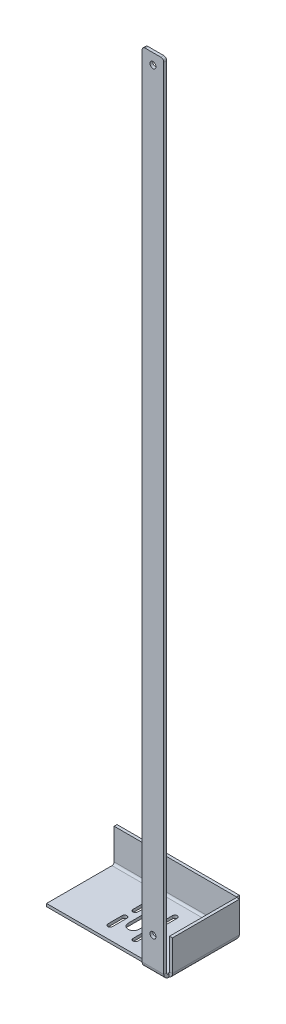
ISO-10303-21;
HEADER;
FILE_DESCRIPTION(('STEP AP214'),'2;1');
FILE_NAME('part.step','',(''),(''),'','','');
FILE_SCHEMA(('AUTOMOTIVE_DESIGN { 1 0 10303 214 1 1 1 1 }'));
ENDSEC;
DATA;
#1=APPLICATION_CONTEXT('core data for automotive mechanical design processes');
#2=APPLICATION_PROTOCOL_DEFINITION('international standard','automotive_design',2000,#1);
#3=PRODUCT_CONTEXT('',#1,'mechanical');
#4=PRODUCT('Part','Part','',(#3));
#5=PRODUCT_RELATED_PRODUCT_CATEGORY('part','',(#4));
#6=PRODUCT_DEFINITION_FORMATION('','',#4);
#7=PRODUCT_DEFINITION_CONTEXT('part definition',#1,'design');
#8=PRODUCT_DEFINITION('design','',#6,#7);
#9=PRODUCT_DEFINITION_SHAPE('','',#8);
#10=(LENGTH_UNIT() NAMED_UNIT(*) SI_UNIT(.MILLI.,.METRE.));
#11=(NAMED_UNIT(*) PLANE_ANGLE_UNIT() SI_UNIT($,.RADIAN.));
#12=(NAMED_UNIT(*) SI_UNIT($,.STERADIAN.) SOLID_ANGLE_UNIT());
#13=UNCERTAINTY_MEASURE_WITH_UNIT(LENGTH_MEASURE(1.E-05),#10,'distance_accuracy_value','');
#14=(GEOMETRIC_REPRESENTATION_CONTEXT(3) GLOBAL_UNCERTAINTY_ASSIGNED_CONTEXT((#13)) GLOBAL_UNIT_ASSIGNED_CONTEXT((#10,
#11,#12)) REPRESENTATION_CONTEXT('',''));
#15=CARTESIAN_POINT('',(0.,0.,0.));
#16=DIRECTION('',(0.,0.,1.));
#17=DIRECTION('',(1.,0.,0.));
#18=AXIS2_PLACEMENT_3D('',#15,#16,#17);
#19=CARTESIAN_POINT('',(28.,-8.20000000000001,-6.99999999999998));
#20=DIRECTION('',(0.,0.,-1.));
#21=DIRECTION('',(-1.,0.,0.));
#22=AXIS2_PLACEMENT_3D('',#19,#20,#21);
#23=PLANE('',#22);
#24=DIRECTION('',(-1.,0.,0.));
#25=VECTOR('',#24,1.);
#26=CARTESIAN_POINT('',(0.,-12.2,-6.99999999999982));
#27=LINE('',#26,#25);
#28=CARTESIAN_POINT('',(30.,-12.2,-6.99999999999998));
#29=VERTEX_POINT('',#28);
#30=CARTESIAN_POINT('',(28.,-12.2,-6.99999999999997));
#31=VERTEX_POINT('',#30);
#32=EDGE_CURVE('E789',#29,#31,#27,.T.);
#33=ORIENTED_EDGE('',*,*,#32,.T.);
#34=CARTESIAN_POINT('',(28.,-5.20000000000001,-6.99999999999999));
#35=DIRECTION('',(0.,0.,-1.));
#36=DIRECTION('',(0.,1.,0.));
#37=AXIS2_PLACEMENT_3D('',#34,#35,#36);
#38=CIRCLE('',#37,7.);
#39=CARTESIAN_POINT('',(30.,-11.9082039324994,-6.99999999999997));
#40=VERTEX_POINT('',#39);
#41=EDGE_CURVE('E841',#31,#40,#38,.F.);
#42=ORIENTED_EDGE('',*,*,#41,.T.);
#43=DIRECTION('',(0.,1.,0.));
#44=VECTOR('',#43,1.);
#45=CARTESIAN_POINT('',(30.,-12.2,-6.99999999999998));
#46=LINE('',#45,#44);
#47=EDGE_CURVE('E768',#40,#29,#46,.F.);
#48=ORIENTED_EDGE('',*,*,#47,.T.);
#49=EDGE_LOOP('',(#33,#42,#48));
#50=FACE_BOUND('',#49,.T.);
#51=ADVANCED_FACE('F96',(#50),#23,.T.);
#52=CARTESIAN_POINT('',(0.,-12.2,0.));
#53=DIRECTION('',(0.,1.,0.));
#54=DIRECTION('',(0.,0.,1.));
#55=AXIS2_PLACEMENT_3D('',#52,#53,#54);
#56=PLANE('',#55);
#57=DIRECTION('',(0.,0.,1.));
#58=VECTOR('',#57,1.);
#59=CARTESIAN_POINT('',(-31.25,-12.2000000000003,-80.));
#60=LINE('',#59,#58);
#61=CARTESIAN_POINT('',(-31.25,-12.2000000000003,-80.));
#62=VERTEX_POINT('',#61);
#63=CARTESIAN_POINT('',(-31.25,-12.2000000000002,-60.));
#64=VERTEX_POINT('',#63);
#65=EDGE_CURVE('E474',#62,#64,#60,.T.);
#66=ORIENTED_EDGE('',*,*,#65,.F.);
#67=CARTESIAN_POINT('',(-34.5,-12.2000000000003,-80.));
#68=DIRECTION('',(0.,-1.,0.));
#69=DIRECTION('',(0.,0.,-1.));
#70=AXIS2_PLACEMENT_3D('',#67,#68,#69);
#71=CIRCLE('',#70,3.25);
#72=CARTESIAN_POINT('',(-37.75,-12.2000000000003,-80.));
#73=VERTEX_POINT('',#72);
#74=EDGE_CURVE('E111',#73,#62,#71,.T.);
#75=ORIENTED_EDGE('',*,*,#74,.F.);
#76=DIRECTION('',(0.,0.,-1.));
#77=VECTOR('',#76,1.);
#78=CARTESIAN_POINT('',(-37.75,-12.2000000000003,-80.));
#79=LINE('',#78,#77);
#80=CARTESIAN_POINT('',(-37.75,-12.2000000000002,-60.));
#81=VERTEX_POINT('',#80);
#82=EDGE_CURVE('E480',#81,#73,#79,.T.);
#83=ORIENTED_EDGE('',*,*,#82,.F.);
#84=CARTESIAN_POINT('',(-34.5,-12.2000000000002,-60.));
#85=DIRECTION('',(0.,-1.,0.));
#86=DIRECTION('',(0.,0.,-1.));
#87=AXIS2_PLACEMENT_3D('',#84,#85,#86);
#88=CIRCLE('',#87,3.25);
#89=EDGE_CURVE('E477',#64,#81,#88,.T.);
#90=ORIENTED_EDGE('',*,*,#89,.F.);
#91=EDGE_LOOP('',(#66,#75,#83,#90));
#92=FACE_BOUND('',#91,.T.);
#93=DIRECTION('',(0.,0.,1.));
#94=VECTOR('',#93,1.);
#95=CARTESIAN_POINT('',(-31.25,-12.2000000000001,-45.));
#96=LINE('',#95,#94);
#97=CARTESIAN_POINT('',(-31.25,-12.2000000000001,-45.));
#98=VERTEX_POINT('',#97);
#99=CARTESIAN_POINT('',(-31.25,-12.2000000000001,-25.));
#100=VERTEX_POINT('',#99);
#101=EDGE_CURVE('E445',#98,#100,#96,.T.);
#102=ORIENTED_EDGE('',*,*,#101,.F.);
#103=CARTESIAN_POINT('',(-34.5,-12.2000000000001,-45.));
#104=DIRECTION('',(0.,-1.,0.));
#105=DIRECTION('',(0.,0.,-1.));
#106=AXIS2_PLACEMENT_3D('',#103,#104,#105);
#107=CIRCLE('',#106,3.25);
#108=CARTESIAN_POINT('',(-37.75,-12.2000000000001,-45.));
#109=VERTEX_POINT('',#108);
#110=EDGE_CURVE('E119',#109,#98,#107,.T.);
#111=ORIENTED_EDGE('',*,*,#110,.F.);
#112=DIRECTION('',(0.,0.,-1.));
#113=VECTOR('',#112,1.);
#114=CARTESIAN_POINT('',(-37.75,-12.2000000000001,-45.));
#115=LINE('',#114,#113);
#116=CARTESIAN_POINT('',(-37.75,-12.2000000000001,-25.));
#117=VERTEX_POINT('',#116);
#118=EDGE_CURVE('E451',#117,#109,#115,.T.);
#119=ORIENTED_EDGE('',*,*,#118,.F.);
#120=CARTESIAN_POINT('',(-34.5,-12.2000000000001,-25.));
#121=DIRECTION('',(0.,-1.,0.));
#122=DIRECTION('',(0.,0.,-1.));
#123=AXIS2_PLACEMENT_3D('',#120,#121,#122);
#124=CIRCLE('',#123,3.25);
#125=EDGE_CURVE('E448',#100,#117,#124,.T.);
#126=ORIENTED_EDGE('',*,*,#125,.F.);
#127=EDGE_LOOP('',(#102,#111,#119,#126));
#128=FACE_BOUND('',#127,.T.);
#129=DIRECTION('',(0.,0.,1.));
#130=VECTOR('',#129,1.);
#131=CARTESIAN_POINT('',(-44.5,-12.2000000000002,-65.));
#132=LINE('',#131,#130);
#133=CARTESIAN_POINT('',(-44.5,-12.2000000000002,-65.));
#134=VERTEX_POINT('',#133);
#135=CARTESIAN_POINT('',(-44.5,-12.2000000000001,-40.));
#136=VERTEX_POINT('',#135);
#137=EDGE_CURVE('E413',#134,#136,#132,.T.);
#138=ORIENTED_EDGE('',*,*,#137,.F.);
#139=CARTESIAN_POINT('',(-52.,-12.2000000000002,-65.));
#140=DIRECTION('',(0.,-1.,0.));
#141=DIRECTION('',(0.,0.,-1.));
#142=AXIS2_PLACEMENT_3D('',#139,#140,#141);
#143=CIRCLE('',#142,7.5);
#144=CARTESIAN_POINT('',(-59.5,-12.2000000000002,-65.));
#145=VERTEX_POINT('',#144);
#146=EDGE_CURVE('E411',#145,#134,#143,.T.);
#147=ORIENTED_EDGE('',*,*,#146,.F.);
#148=DIRECTION('',(0.,0.,-1.));
#149=VECTOR('',#148,1.);
#150=CARTESIAN_POINT('',(-59.5,-12.2000000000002,-65.));
#151=LINE('',#150,#149);
#152=CARTESIAN_POINT('',(-59.5,-12.2000000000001,-40.));
#153=VERTEX_POINT('',#152);
#154=EDGE_CURVE('E419',#153,#145,#151,.T.);
#155=ORIENTED_EDGE('',*,*,#154,.F.);
#156=CARTESIAN_POINT('',(-52.,-12.2000000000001,-40.));
#157=DIRECTION('',(0.,-1.,0.));
#158=DIRECTION('',(0.,0.,-1.));
#159=AXIS2_PLACEMENT_3D('',#156,#157,#158);
#160=CIRCLE('',#159,7.5);
#161=EDGE_CURVE('E416',#136,#153,#160,.T.);
#162=ORIENTED_EDGE('',*,*,#161,.F.);
#163=EDGE_LOOP('',(#138,#147,#155,#162));
#164=FACE_BOUND('',#163,.T.);
#165=DIRECTION('',(0.,0.,1.));
#166=VECTOR('',#165,1.);
#167=CARTESIAN_POINT('',(-66.25,-12.2000000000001,-45.));
#168=LINE('',#167,#166);
#169=CARTESIAN_POINT('',(-66.25,-12.2000000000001,-45.));
#170=VERTEX_POINT('',#169);
#171=CARTESIAN_POINT('',(-66.25,-12.2000000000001,-25.));
#172=VERTEX_POINT('',#171);
#173=EDGE_CURVE('E385',#170,#172,#168,.T.);
#174=ORIENTED_EDGE('',*,*,#173,.F.);
#175=CARTESIAN_POINT('',(-69.5,-12.2000000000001,-45.));
#176=DIRECTION('',(0.,-1.,0.));
#177=DIRECTION('',(0.,0.,-1.));
#178=AXIS2_PLACEMENT_3D('',#175,#176,#177);
#179=CIRCLE('',#178,3.25);
#180=CARTESIAN_POINT('',(-72.75,-12.2000000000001,-45.));
#181=VERTEX_POINT('',#180);
#182=EDGE_CURVE('E377',#181,#170,#179,.T.);
#183=ORIENTED_EDGE('',*,*,#182,.F.);
#184=DIRECTION('',(0.,0.,-1.));
#185=VECTOR('',#184,1.);
#186=CARTESIAN_POINT('',(-72.75,-12.2000000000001,-45.));
#187=LINE('',#186,#185);
#188=CARTESIAN_POINT('',(-72.75,-12.2000000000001,-25.));
#189=VERTEX_POINT('',#188);
#190=EDGE_CURVE('E378',#189,#181,#187,.T.);
#191=ORIENTED_EDGE('',*,*,#190,.F.);
#192=CARTESIAN_POINT('',(-69.5,-12.2000000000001,-25.));
#193=DIRECTION('',(0.,-1.,0.));
#194=DIRECTION('',(0.,0.,-1.));
#195=AXIS2_PLACEMENT_3D('',#192,#193,#194);
#196=CIRCLE('',#195,3.25);
#197=EDGE_CURVE('E392',#172,#189,#196,.T.);
#198=ORIENTED_EDGE('',*,*,#197,.F.);
#199=EDGE_LOOP('',(#174,#183,#191,#198));
#200=FACE_BOUND('',#199,.T.);
#201=DIRECTION('',(0.,0.,1.));
#202=VECTOR('',#201,1.);
#203=CARTESIAN_POINT('',(-66.25,-12.2000000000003,-80.));
#204=LINE('',#203,#202);
#205=CARTESIAN_POINT('',(-66.25,-12.2000000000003,-80.));
#206=VERTEX_POINT('',#205);
#207=CARTESIAN_POINT('',(-66.25,-12.2000000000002,-60.));
#208=VERTEX_POINT('',#207);
#209=EDGE_CURVE('E503',#206,#208,#204,.T.);
#210=ORIENTED_EDGE('',*,*,#209,.F.);
#211=CARTESIAN_POINT('',(-69.5,-12.2000000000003,-80.));
#212=DIRECTION('',(0.,-1.,0.));
#213=DIRECTION('',(0.,0.,-1.));
#214=AXIS2_PLACEMENT_3D('',#211,#212,#213);
#215=CIRCLE('',#214,3.25);
#216=CARTESIAN_POINT('',(-72.75,-12.2000000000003,-80.));
#217=VERTEX_POINT('',#216);
#218=EDGE_CURVE('E501',#217,#206,#215,.T.);
#219=ORIENTED_EDGE('',*,*,#218,.F.);
#220=DIRECTION('',(0.,0.,-1.));
#221=VECTOR('',#220,1.);
#222=CARTESIAN_POINT('',(-72.75,-12.2000000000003,-80.));
#223=LINE('',#222,#221);
#224=CARTESIAN_POINT('',(-72.75,-12.2000000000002,-60.));
#225=VERTEX_POINT('',#224);
#226=EDGE_CURVE('E509',#225,#217,#223,.T.);
#227=ORIENTED_EDGE('',*,*,#226,.F.);
#228=CARTESIAN_POINT('',(-69.5,-12.2000000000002,-60.));
#229=DIRECTION('',(0.,-1.,0.));
#230=DIRECTION('',(0.,0.,-1.));
#231=AXIS2_PLACEMENT_3D('',#228,#229,#230);
#232=CIRCLE('',#231,3.25);
#233=EDGE_CURVE('E506',#208,#225,#232,.T.);
#234=ORIENTED_EDGE('',*,*,#233,.F.);
#235=EDGE_LOOP('',(#210,#219,#227,#234));
#236=FACE_BOUND('',#235,.T.);
#237=DIRECTION('',(-1.,0.,0.));
#238=VECTOR('',#237,1.);
#239=CARTESIAN_POINT('',(-140.,-12.2000000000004,-98.));
#240=LINE('',#239,#238);
#241=CARTESIAN_POINT('',(-140.,-12.2000000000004,-98.));
#242=VERTEX_POINT('',#241);
#243=CARTESIAN_POINT('',(28.,-12.2000000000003,-98.));
#244=VERTEX_POINT('',#243);
#245=EDGE_CURVE('E561',#242,#244,#240,.F.);
#246=ORIENTED_EDGE('',*,*,#245,.T.);
#247=DIRECTION('',(0.,0.,-1.));
#248=VECTOR('',#247,1.);
#249=CARTESIAN_POINT('',(28.,-12.2000000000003,-100.292893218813));
#250=LINE('',#249,#248);
#251=EDGE_CURVE('E847',#244,#31,#250,.F.);
#252=ORIENTED_EDGE('',*,*,#251,.T.);
#253=DIRECTION('',(-1.,0.,0.));
#254=VECTOR('',#253,1.);
#255=CARTESIAN_POINT('',(30.,-12.2,-6.99999999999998));
#256=LINE('',#255,#254);
#257=CARTESIAN_POINT('',(0.,-12.2,-6.99999999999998));
#258=VERTEX_POINT('',#257);
#259=EDGE_CURVE('E752',#258,#31,#256,.F.);
#260=ORIENTED_EDGE('',*,*,#259,.F.);
#261=DIRECTION('',(1.,0.,0.));
#262=VECTOR('',#261,1.);
#263=CARTESIAN_POINT('',(-140.,-12.2,-6.99999999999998));
#264=LINE('',#263,#262);
#265=CARTESIAN_POINT('',(-140.,-12.2,-6.99999999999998));
#266=VERTEX_POINT('',#265);
#267=EDGE_CURVE('E777',#266,#258,#264,.T.);
#268=ORIENTED_EDGE('',*,*,#267,.F.);
#269=DIRECTION('',(0.,0.,1.));
#270=VECTOR('',#269,1.);
#271=CARTESIAN_POINT('',(-140.,-12.2000000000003,-100.));
#272=LINE('',#271,#270);
#273=EDGE_CURVE('E787',#242,#266,#272,.T.);
#274=ORIENTED_EDGE('',*,*,#273,.F.);
#275=EDGE_LOOP('',(#246,#252,#260,#268,#274));
#276=FACE_BOUND('',#275,.T.);
#277=ADVANCED_FACE('F613',(#92,#128,#164,#200,#236,#276),#56,.F.);
#278=CARTESIAN_POINT('',(0.,-8.19999999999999,0.));
#279=DIRECTION('',(0.,1.,0.));
#280=DIRECTION('',(0.,0.,1.));
#281=AXIS2_PLACEMENT_3D('',#278,#279,#280);
#282=PLANE('',#281);
#283=CARTESIAN_POINT('',(-34.5,-8.20000000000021,-80.));
#284=DIRECTION('',(0.,1.,0.));
#285=DIRECTION('',(0.,0.,1.));
#286=AXIS2_PLACEMENT_3D('',#283,#284,#285);
#287=CIRCLE('',#286,3.25);
#288=CARTESIAN_POINT('',(-37.75,-8.20000000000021,-80.0000000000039));
#289=VERTEX_POINT('',#288);
#290=CARTESIAN_POINT('',(-31.25,-8.20000000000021,-80.0000000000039));
#291=VERTEX_POINT('',#290);
#292=EDGE_CURVE('E470',#289,#291,#287,.F.);
#293=ORIENTED_EDGE('',*,*,#292,.T.);
#294=DIRECTION('',(0.,0.,1.));
#295=VECTOR('',#294,1.);
#296=CARTESIAN_POINT('',(-31.25,-8.20000000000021,-80.));
#297=LINE('',#296,#295);
#298=CARTESIAN_POINT('',(-31.25,-8.20000000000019,-60.));
#299=VERTEX_POINT('',#298);
#300=EDGE_CURVE('E438',#291,#299,#297,.T.);
#301=ORIENTED_EDGE('',*,*,#300,.T.);
#302=CARTESIAN_POINT('',(-34.5,-8.20000000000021,-60.));
#303=DIRECTION('',(0.,1.,0.));
#304=DIRECTION('',(0.,0.,1.));
#305=AXIS2_PLACEMENT_3D('',#302,#303,#304);
#306=CIRCLE('',#305,3.25);
#307=CARTESIAN_POINT('',(-37.75,-8.20000000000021,-60.0000000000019));
#308=VERTEX_POINT('',#307);
#309=EDGE_CURVE('E464',#299,#308,#306,.F.);
#310=ORIENTED_EDGE('',*,*,#309,.T.);
#311=DIRECTION('',(0.,0.,-1.));
#312=VECTOR('',#311,1.);
#313=CARTESIAN_POINT('',(-37.75,-8.20000000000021,-80.));
#314=LINE('',#313,#312);
#315=EDGE_CURVE('E467',#308,#289,#314,.T.);
#316=ORIENTED_EDGE('',*,*,#315,.T.);
#317=EDGE_LOOP('',(#293,#301,#310,#316));
#318=FACE_BOUND('',#317,.T.);
#319=CARTESIAN_POINT('',(-34.5,-8.20000000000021,-45.));
#320=DIRECTION('',(0.,1.,0.));
#321=DIRECTION('',(0.,0.,1.));
#322=AXIS2_PLACEMENT_3D('',#319,#320,#321);
#323=CIRCLE('',#322,3.25);
#324=CARTESIAN_POINT('',(-37.75,-8.20000000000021,-45.0000000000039));
#325=VERTEX_POINT('',#324);
#326=CARTESIAN_POINT('',(-31.25,-8.20000000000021,-45.0000000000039));
#327=VERTEX_POINT('',#326);
#328=EDGE_CURVE('E441',#325,#327,#323,.F.);
#329=ORIENTED_EDGE('',*,*,#328,.T.);
#330=DIRECTION('',(0.,0.,1.));
#331=VECTOR('',#330,1.);
#332=CARTESIAN_POINT('',(-31.25,-8.20000000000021,-45.));
#333=LINE('',#332,#331);
#334=CARTESIAN_POINT('',(-31.25,-8.20000000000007,-25.));
#335=VERTEX_POINT('',#334);
#336=EDGE_CURVE('E405',#327,#335,#333,.T.);
#337=ORIENTED_EDGE('',*,*,#336,.T.);
#338=CARTESIAN_POINT('',(-34.5,-8.19999999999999,-25.));
#339=DIRECTION('',(0.,1.,0.));
#340=DIRECTION('',(0.,0.,1.));
#341=AXIS2_PLACEMENT_3D('',#338,#339,#340);
#342=CIRCLE('',#341,3.25);
#343=CARTESIAN_POINT('',(-37.75,-8.19999999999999,-25.0000000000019));
#344=VERTEX_POINT('',#343);
#345=EDGE_CURVE('E434',#335,#344,#342,.F.);
#346=ORIENTED_EDGE('',*,*,#345,.T.);
#347=DIRECTION('',(0.,0.,-1.));
#348=VECTOR('',#347,1.);
#349=CARTESIAN_POINT('',(-37.75,-8.20000000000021,-45.));
#350=LINE('',#349,#348);
#351=EDGE_CURVE('E437',#344,#325,#350,.T.);
#352=ORIENTED_EDGE('',*,*,#351,.T.);
#353=EDGE_LOOP('',(#329,#337,#346,#352));
#354=FACE_BOUND('',#353,.T.);
#355=CARTESIAN_POINT('',(-52.,-8.20000000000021,-65.));
#356=DIRECTION('',(0.,1.,0.));
#357=DIRECTION('',(0.,0.,1.));
#358=AXIS2_PLACEMENT_3D('',#355,#356,#357);
#359=CIRCLE('',#358,7.5);
#360=CARTESIAN_POINT('',(-59.5,-8.20000000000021,-65.0000000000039));
#361=VERTEX_POINT('',#360);
#362=CARTESIAN_POINT('',(-44.5,-8.20000000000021,-65.0000000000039));
#363=VERTEX_POINT('',#362);
#364=EDGE_CURVE('E408',#361,#363,#359,.F.);
#365=ORIENTED_EDGE('',*,*,#364,.T.);
#366=DIRECTION('',(0.,0.,1.));
#367=VECTOR('',#366,1.);
#368=CARTESIAN_POINT('',(-44.5,-8.20000000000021,-65.));
#369=LINE('',#368,#367);
#370=CARTESIAN_POINT('',(-44.5,-8.20000000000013,-40.));
#371=VERTEX_POINT('',#370);
#372=EDGE_CURVE('E425',#363,#371,#369,.T.);
#373=ORIENTED_EDGE('',*,*,#372,.T.);
#374=CARTESIAN_POINT('',(-52.,-8.20000000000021,-40.));
#375=DIRECTION('',(0.,1.,0.));
#376=DIRECTION('',(0.,0.,1.));
#377=AXIS2_PLACEMENT_3D('',#374,#375,#376);
#378=CIRCLE('',#377,7.5);
#379=CARTESIAN_POINT('',(-59.5,-8.20000000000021,-40.0000000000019));
#380=VERTEX_POINT('',#379);
#381=EDGE_CURVE('E401',#371,#380,#378,.F.);
#382=ORIENTED_EDGE('',*,*,#381,.T.);
#383=DIRECTION('',(0.,0.,-1.));
#384=VECTOR('',#383,1.);
#385=CARTESIAN_POINT('',(-59.5,-8.20000000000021,-65.));
#386=LINE('',#385,#384);
#387=EDGE_CURVE('E404',#380,#361,#386,.T.);
#388=ORIENTED_EDGE('',*,*,#387,.T.);
#389=EDGE_LOOP('',(#365,#373,#382,#388));
#390=FACE_BOUND('',#389,.T.);
#391=CARTESIAN_POINT('',(-69.5,-8.20000000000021,-45.));
#392=DIRECTION('',(0.,1.,0.));
#393=DIRECTION('',(0.,0.,1.));
#394=AXIS2_PLACEMENT_3D('',#391,#392,#393);
#395=CIRCLE('',#394,3.25);
#396=CARTESIAN_POINT('',(-72.75,-8.20000000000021,-45.0000000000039));
#397=VERTEX_POINT('',#396);
#398=CARTESIAN_POINT('',(-66.25,-8.20000000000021,-45.0000000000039));
#399=VERTEX_POINT('',#398);
#400=EDGE_CURVE('E374',#397,#399,#395,.F.);
#401=ORIENTED_EDGE('',*,*,#400,.T.);
#402=DIRECTION('',(0.,0.,1.));
#403=VECTOR('',#402,1.);
#404=CARTESIAN_POINT('',(-66.25,-8.20000000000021,-45.));
#405=LINE('',#404,#403);
#406=CARTESIAN_POINT('',(-66.25,-8.20000000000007,-25.));
#407=VERTEX_POINT('',#406);
#408=EDGE_CURVE('E358',#399,#407,#405,.T.);
#409=ORIENTED_EDGE('',*,*,#408,.T.);
#410=CARTESIAN_POINT('',(-69.5,-8.19999999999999,-25.));
#411=DIRECTION('',(0.,1.,0.));
#412=DIRECTION('',(0.,0.,1.));
#413=AXIS2_PLACEMENT_3D('',#410,#411,#412);
#414=CIRCLE('',#413,3.25);
#415=CARTESIAN_POINT('',(-72.75,-8.19999999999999,-25.0000000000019));
#416=VERTEX_POINT('',#415);
#417=EDGE_CURVE('E387',#407,#416,#414,.F.);
#418=ORIENTED_EDGE('',*,*,#417,.T.);
#419=DIRECTION('',(0.,0.,-1.));
#420=VECTOR('',#419,1.);
#421=CARTESIAN_POINT('',(-72.75,-8.20000000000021,-45.));
#422=LINE('',#421,#420);
#423=EDGE_CURVE('E383',#416,#397,#422,.T.);
#424=ORIENTED_EDGE('',*,*,#423,.T.);
#425=EDGE_LOOP('',(#401,#409,#418,#424));
#426=FACE_BOUND('',#425,.T.);
#427=CARTESIAN_POINT('',(-69.5,-8.20000000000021,-80.));
#428=DIRECTION('',(0.,1.,0.));
#429=DIRECTION('',(0.,0.,1.));
#430=AXIS2_PLACEMENT_3D('',#427,#428,#429);
#431=CIRCLE('',#430,3.25);
#432=CARTESIAN_POINT('',(-72.75,-8.20000000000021,-80.0000000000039));
#433=VERTEX_POINT('',#432);
#434=CARTESIAN_POINT('',(-66.25,-8.20000000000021,-80.0000000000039));
#435=VERTEX_POINT('',#434);
#436=EDGE_CURVE('E498',#433,#435,#431,.F.);
#437=ORIENTED_EDGE('',*,*,#436,.T.);
#438=DIRECTION('',(0.,0.,1.));
#439=VECTOR('',#438,1.);
#440=CARTESIAN_POINT('',(-66.25,-8.20000000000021,-80.));
#441=LINE('',#440,#439);
#442=CARTESIAN_POINT('',(-66.25,-8.20000000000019,-60.));
#443=VERTEX_POINT('',#442);
#444=EDGE_CURVE('E515',#435,#443,#441,.T.);
#445=ORIENTED_EDGE('',*,*,#444,.T.);
#446=CARTESIAN_POINT('',(-69.5,-8.20000000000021,-60.));
#447=DIRECTION('',(0.,1.,0.));
#448=DIRECTION('',(0.,0.,1.));
#449=AXIS2_PLACEMENT_3D('',#446,#447,#448);
#450=CIRCLE('',#449,3.25);
#451=CARTESIAN_POINT('',(-72.75,-8.20000000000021,-60.0000000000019));
#452=VERTEX_POINT('',#451);
#453=EDGE_CURVE('E369',#443,#452,#450,.F.);
#454=ORIENTED_EDGE('',*,*,#453,.T.);
#455=DIRECTION('',(0.,0.,-1.));
#456=VECTOR('',#455,1.);
#457=CARTESIAN_POINT('',(-72.75,-8.20000000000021,-80.));
#458=LINE('',#457,#456);
#459=EDGE_CURVE('E495',#452,#433,#458,.T.);
#460=ORIENTED_EDGE('',*,*,#459,.T.);
#461=EDGE_LOOP('',(#437,#445,#454,#460));
#462=FACE_BOUND('',#461,.T.);
#463=DIRECTION('',(0.,0.,-1.));
#464=VECTOR('',#463,1.);
#465=CARTESIAN_POINT('',(28.,-8.20000000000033,-100.292893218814));
#466=LINE('',#465,#464);
#467=CARTESIAN_POINT('',(28.,-8.20000000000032,-98.));
#468=VERTEX_POINT('',#467);
#469=CARTESIAN_POINT('',(28.,-8.20000000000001,-6.99999999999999));
#470=VERTEX_POINT('',#469);
#471=EDGE_CURVE('E800',#468,#470,#466,.F.);
#472=ORIENTED_EDGE('',*,*,#471,.F.);
#473=DIRECTION('',(-1.,0.,0.));
#474=VECTOR('',#473,1.);
#475=CARTESIAN_POINT('',(-140.,-8.20000000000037,-98.));
#476=LINE('',#475,#474);
#477=CARTESIAN_POINT('',(-140.,-8.20000000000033,-98.));
#478=VERTEX_POINT('',#477);
#479=EDGE_CURVE('E565',#478,#468,#476,.F.);
#480=ORIENTED_EDGE('',*,*,#479,.F.);
#481=DIRECTION('',(0.,0.,-1.));
#482=VECTOR('',#481,1.);
#483=CARTESIAN_POINT('',(-140.,-8.20000000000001,-6.99999999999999));
#484=LINE('',#483,#482);
#485=CARTESIAN_POINT('',(-140.,-8.20000000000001,-6.99999999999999));
#486=VERTEX_POINT('',#485);
#487=EDGE_CURVE('E782',#486,#478,#484,.T.);
#488=ORIENTED_EDGE('',*,*,#487,.F.);
#489=DIRECTION('',(1.,0.,0.));
#490=VECTOR('',#489,1.);
#491=CARTESIAN_POINT('',(-140.,-8.20000000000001,-6.99999999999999));
#492=LINE('',#491,#490);
#493=CARTESIAN_POINT('',(0.,-8.20000000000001,-6.99999999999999));
#494=VERTEX_POINT('',#493);
#495=EDGE_CURVE('E779',#486,#494,#492,.T.);
#496=ORIENTED_EDGE('',*,*,#495,.T.);
#497=DIRECTION('',(-1.,0.,0.));
#498=VECTOR('',#497,1.);
#499=CARTESIAN_POINT('',(30.,-8.20000000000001,-6.99999999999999));
#500=LINE('',#499,#498);
#501=EDGE_CURVE('E767',#470,#494,#500,.T.);
#502=ORIENTED_EDGE('',*,*,#501,.F.);
#503=EDGE_LOOP('',(#472,#480,#488,#496,#502));
#504=FACE_BOUND('',#503,.T.);
#505=ADVANCED_FACE('F381',(#318,#354,#390,#426,#462,#504),#282,.T.);
#506=CARTESIAN_POINT('',(-140.,0.,0.));
#507=DIRECTION('',(-1.,0.,0.));
#508=DIRECTION('',(0.,0.,1.));
#509=AXIS2_PLACEMENT_3D('',#506,#507,#508);
#510=PLANE('',#509);
#511=ORIENTED_EDGE('',*,*,#487,.T.);
#512=DIRECTION('',(0.,-1.,0.));
#513=VECTOR('',#512,1.);
#514=CARTESIAN_POINT('',(-140.,-8.20000000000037,-98.));
#515=LINE('',#514,#513);
#516=EDGE_CURVE('E571',#478,#242,#515,.T.);
#517=ORIENTED_EDGE('',*,*,#516,.T.);
#518=ORIENTED_EDGE('',*,*,#273,.T.);
#519=DIRECTION('',(0.,1.,0.));
#520=VECTOR('',#519,1.);
#521=CARTESIAN_POINT('',(-140.,-12.2,-6.99999999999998));
#522=LINE('',#521,#520);
#523=EDGE_CURVE('E785',#266,#486,#522,.T.);
#524=ORIENTED_EDGE('',*,*,#523,.T.);
#525=EDGE_LOOP('',(#511,#517,#518,#524));
#526=FACE_BOUND('',#525,.T.);
#527=ADVANCED_FACE('F629',(#526),#510,.T.);
#528=CARTESIAN_POINT('',(0.,0.,-4.));
#529=DIRECTION('',(-1.,0.,0.));
#530=DIRECTION('',(0.,0.,1.));
#531=AXIS2_PLACEMENT_3D('',#528,#529,#530);
#532=PLANE('',#531);
#533=DIRECTION('',(0.,-1.,0.));
#534=VECTOR('',#533,1.);
#535=CARTESIAN_POINT('',(0.,0.,0.));
#536=LINE('',#535,#534);
#537=CARTESIAN_POINT('',(0.,1093.56,0.));
#538=VERTEX_POINT('',#537);
#539=CARTESIAN_POINT('',(0.,-5.20000000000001,0.));
#540=VERTEX_POINT('',#539);
#541=EDGE_CURVE('E720',#538,#540,#536,.T.);
#542=ORIENTED_EDGE('',*,*,#541,.F.);
#543=DIRECTION('',(0.,0.,1.));
#544=VECTOR('',#543,1.);
#545=CARTESIAN_POINT('',(0.,1093.56,-4.));
#546=LINE('',#545,#544);
#547=CARTESIAN_POINT('',(0.,1093.56,-4.));
#548=VERTEX_POINT('',#547);
#549=EDGE_CURVE('E694',#538,#548,#546,.F.);
#550=ORIENTED_EDGE('',*,*,#549,.T.);
#551=DIRECTION('',(0.,-1.,0.));
#552=VECTOR('',#551,1.);
#553=CARTESIAN_POINT('',(0.,0.,-4.));
#554=LINE('',#553,#552);
#555=CARTESIAN_POINT('',(0.,-5.20000000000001,-4.));
#556=VERTEX_POINT('',#555);
#557=EDGE_CURVE('E716',#548,#556,#554,.T.);
#558=ORIENTED_EDGE('',*,*,#557,.T.);
#559=DIRECTION('',(0.,0.,1.));
#560=VECTOR('',#559,1.);
#561=CARTESIAN_POINT('',(0.,-5.20000000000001,-4.));
#562=LINE('',#561,#560);
#563=EDGE_CURVE('E742',#556,#540,#562,.T.);
#564=ORIENTED_EDGE('',*,*,#563,.T.);
#565=EDGE_LOOP('',(#542,#550,#558,#564));
#566=FACE_BOUND('',#565,.T.);
#567=ADVANCED_FACE('F632',(#566),#532,.T.);
#568=CARTESIAN_POINT('',(0.,1097.56,-4.));
#569=DIRECTION('',(0.,1.,0.));
#570=DIRECTION('',(0.,0.,1.));
#571=AXIS2_PLACEMENT_3D('',#568,#569,#570);
#572=PLANE('',#571);
#573=DIRECTION('',(-1.,0.,0.));
#574=VECTOR('',#573,1.);
#575=CARTESIAN_POINT('',(0.,1097.56,-4.));
#576=LINE('',#575,#574);
#577=CARTESIAN_POINT('',(26.,1097.56,-4.));
#578=VERTEX_POINT('',#577);
#579=CARTESIAN_POINT('',(4.,1097.56,-4.));
#580=VERTEX_POINT('',#579);
#581=EDGE_CURVE('E712',#578,#580,#576,.T.);
#582=ORIENTED_EDGE('',*,*,#581,.T.);
#583=DIRECTION('',(0.,0.,1.));
#584=VECTOR('',#583,1.);
#585=CARTESIAN_POINT('',(4.,1097.56,-4.));
#586=LINE('',#585,#584);
#587=CARTESIAN_POINT('',(4.,1097.56,0.));
#588=VERTEX_POINT('',#587);
#589=EDGE_CURVE('E696',#580,#588,#586,.T.);
#590=ORIENTED_EDGE('',*,*,#589,.T.);
#591=DIRECTION('',(-1.,0.,0.));
#592=VECTOR('',#591,1.);
#593=CARTESIAN_POINT('',(0.,1097.56,0.));
#594=LINE('',#593,#592);
#595=CARTESIAN_POINT('',(26.,1097.56,0.));
#596=VERTEX_POINT('',#595);
#597=EDGE_CURVE('E713',#596,#588,#594,.T.);
#598=ORIENTED_EDGE('',*,*,#597,.F.);
#599=DIRECTION('',(0.,0.,1.));
#600=VECTOR('',#599,1.);
#601=CARTESIAN_POINT('',(26.,1097.56,-4.));
#602=LINE('',#601,#600);
#603=EDGE_CURVE('E710',#596,#578,#602,.F.);
#604=ORIENTED_EDGE('',*,*,#603,.T.);
#605=EDGE_LOOP('',(#582,#590,#598,#604));
#606=FACE_BOUND('',#605,.T.);
#607=ADVANCED_FACE('F676',(#606),#572,.T.);
#608=CARTESIAN_POINT('',(30.,0.,-4.));
#609=DIRECTION('',(1.,0.,0.));
#610=DIRECTION('',(0.,0.,-1.));
#611=AXIS2_PLACEMENT_3D('',#608,#609,#610);
#612=PLANE('',#611);
#613=DIRECTION('',(0.,1.,0.));
#614=VECTOR('',#613,1.);
#615=CARTESIAN_POINT('',(30.,0.,-4.));
#616=LINE('',#615,#614);
#617=CARTESIAN_POINT('',(30.,-5.20000000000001,-4.));
#618=VERTEX_POINT('',#617);
#619=CARTESIAN_POINT('',(30.,1093.56,-4.));
#620=VERTEX_POINT('',#619);
#621=EDGE_CURVE('E725',#618,#620,#616,.T.);
#622=ORIENTED_EDGE('',*,*,#621,.T.);
#623=DIRECTION('',(0.,0.,1.));
#624=VECTOR('',#623,1.);
#625=CARTESIAN_POINT('',(30.,1093.56,-4.));
#626=LINE('',#625,#624);
#627=CARTESIAN_POINT('',(30.,1093.56,0.));
#628=VERTEX_POINT('',#627);
#629=EDGE_CURVE('E13',#620,#628,#626,.T.);
#630=ORIENTED_EDGE('',*,*,#629,.T.);
#631=DIRECTION('',(0.,1.,0.));
#632=VECTOR('',#631,1.);
#633=CARTESIAN_POINT('',(30.,0.,0.));
#634=LINE('',#633,#632);
#635=CARTESIAN_POINT('',(30.,-5.20000000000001,0.));
#636=VERTEX_POINT('',#635);
#637=EDGE_CURVE('E717',#636,#628,#634,.T.);
#638=ORIENTED_EDGE('',*,*,#637,.F.);
#639=DIRECTION('',(0.,0.,1.));
#640=VECTOR('',#639,1.);
#641=CARTESIAN_POINT('',(30.,-5.20000000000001,-4.));
#642=LINE('',#641,#640);
#643=EDGE_CURVE('E739',#618,#636,#642,.T.);
#644=ORIENTED_EDGE('',*,*,#643,.F.);
#645=EDGE_LOOP('',(#622,#630,#638,#644));
#646=FACE_BOUND('',#645,.T.);
#647=ADVANCED_FACE('F671',(#646),#612,.T.);
#648=CARTESIAN_POINT('',(0.,0.,-4.));
#649=DIRECTION('',(0.,0.,-1.));
#650=DIRECTION('',(-1.,0.,0.));
#651=AXIS2_PLACEMENT_3D('',#648,#649,#650);
#652=PLANE('',#651);
#653=CARTESIAN_POINT('',(15.,34.56,-4.));
#654=DIRECTION('',(0.,0.,1.));
#655=DIRECTION('',(1.,0.,0.));
#656=AXIS2_PLACEMENT_3D('',#653,#654,#655);
#657=CIRCLE('',#656,4.25);
#658=CARTESIAN_POINT('',(19.25,34.56,-4.));
#659=VERTEX_POINT('',#658);
#660=EDGE_CURVE('E733',#659,#659,#657,.T.);
#661=ORIENTED_EDGE('',*,*,#660,.T.);
#662=EDGE_LOOP('',(#661));
#663=FACE_BOUND('',#662,.T.);
#664=CARTESIAN_POINT('',(15.,1082.56,-4.));
#665=DIRECTION('',(0.,0.,1.));
#666=DIRECTION('',(1.,0.,0.));
#667=AXIS2_PLACEMENT_3D('',#664,#665,#666);
#668=CIRCLE('',#667,4.25000000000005);
#669=CARTESIAN_POINT('',(19.25,1082.56,-4.));
#670=VERTEX_POINT('',#669);
#671=EDGE_CURVE('E723',#670,#670,#668,.T.);
#672=ORIENTED_EDGE('',*,*,#671,.T.);
#673=EDGE_LOOP('',(#672));
#674=FACE_BOUND('',#673,.T.);
#675=ORIENTED_EDGE('',*,*,#557,.F.);
#676=CARTESIAN_POINT('',(4.,1093.56,-4.));
#677=DIRECTION('',(0.,0.,-1.));
#678=DIRECTION('',(-1.,0.,0.));
#679=AXIS2_PLACEMENT_3D('',#676,#677,#678);
#680=CIRCLE('',#679,4.);
#681=EDGE_CURVE('E104',#548,#580,#680,.T.);
#682=ORIENTED_EDGE('',*,*,#681,.T.);
#683=ORIENTED_EDGE('',*,*,#581,.F.);
#684=CARTESIAN_POINT('',(26.,1093.56,-4.));
#685=DIRECTION('',(0.,0.,-1.));
#686=DIRECTION('',(-1.,0.,0.));
#687=AXIS2_PLACEMENT_3D('',#684,#685,#686);
#688=CIRCLE('',#687,4.);
#689=EDGE_CURVE('E701',#578,#620,#688,.T.);
#690=ORIENTED_EDGE('',*,*,#689,.T.);
#691=ORIENTED_EDGE('',*,*,#621,.F.);
#692=DIRECTION('',(-1.,0.,0.));
#693=VECTOR('',#692,1.);
#694=CARTESIAN_POINT('',(0.,-5.20000000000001,-4.));
#695=LINE('',#694,#693);
#696=EDGE_CURVE('E751',#556,#618,#695,.F.);
#697=ORIENTED_EDGE('',*,*,#696,.F.);
#698=EDGE_LOOP('',(#675,#682,#683,#690,#691,#697));
#699=FACE_BOUND('',#698,.T.);
#700=ADVANCED_FACE('F668',(#663,#674,#699),#652,.T.);
#701=CARTESIAN_POINT('',(0.,0.,0.));
#702=DIRECTION('',(0.,0.,-1.));
#703=DIRECTION('',(-1.,0.,0.));
#704=AXIS2_PLACEMENT_3D('',#701,#702,#703);
#705=PLANE('',#704);
#706=CARTESIAN_POINT('',(15.,34.56,0.));
#707=DIRECTION('',(0.,0.,1.));
#708=DIRECTION('',(1.,0.,0.));
#709=AXIS2_PLACEMENT_3D('',#706,#707,#708);
#710=CIRCLE('',#709,4.25);
#711=CARTESIAN_POINT('',(19.25,34.56,0.));
#712=VERTEX_POINT('',#711);
#713=EDGE_CURVE('E736',#712,#712,#710,.T.);
#714=ORIENTED_EDGE('',*,*,#713,.F.);
#715=EDGE_LOOP('',(#714));
#716=FACE_BOUND('',#715,.T.);
#717=CARTESIAN_POINT('',(15.,1082.56,0.));
#718=DIRECTION('',(0.,0.,1.));
#719=DIRECTION('',(1.,0.,0.));
#720=AXIS2_PLACEMENT_3D('',#717,#718,#719);
#721=CIRCLE('',#720,4.25000000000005);
#722=CARTESIAN_POINT('',(19.25,1082.56,0.));
#723=VERTEX_POINT('',#722);
#724=EDGE_CURVE('E730',#723,#723,#721,.T.);
#725=ORIENTED_EDGE('',*,*,#724,.F.);
#726=EDGE_LOOP('',(#725));
#727=FACE_BOUND('',#726,.T.);
#728=ORIENTED_EDGE('',*,*,#597,.T.);
#729=CARTESIAN_POINT('',(4.,1093.56,0.));
#730=DIRECTION('',(0.,0.,-1.));
#731=DIRECTION('',(-1.,0.,0.));
#732=AXIS2_PLACEMENT_3D('',#729,#730,#731);
#733=CIRCLE('',#732,4.);
#734=EDGE_CURVE('E705',#588,#538,#733,.F.);
#735=ORIENTED_EDGE('',*,*,#734,.T.);
#736=ORIENTED_EDGE('',*,*,#541,.T.);
#737=DIRECTION('',(-1.,0.,0.));
#738=VECTOR('',#737,1.);
#739=CARTESIAN_POINT('',(0.,-5.20000000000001,0.));
#740=LINE('',#739,#738);
#741=EDGE_CURVE('E760',#540,#636,#740,.F.);
#742=ORIENTED_EDGE('',*,*,#741,.T.);
#743=ORIENTED_EDGE('',*,*,#637,.T.);
#744=CARTESIAN_POINT('',(26.,1093.56,0.));
#745=DIRECTION('',(0.,0.,-1.));
#746=DIRECTION('',(-1.,0.,0.));
#747=AXIS2_PLACEMENT_3D('',#744,#745,#746);
#748=CIRCLE('',#747,4.);
#749=EDGE_CURVE('E707',#628,#596,#748,.F.);
#750=ORIENTED_EDGE('',*,*,#749,.T.);
#751=EDGE_LOOP('',(#728,#735,#736,#742,#743,#750));
#752=FACE_BOUND('',#751,.T.);
#753=ADVANCED_FACE('F666',(#716,#727,#752),#705,.F.);
#754=CARTESIAN_POINT('',(15.,1082.56,-4.));
#755=DIRECTION('',(0.,0.,1.));
#756=DIRECTION('',(1.,0.,0.));
#757=AXIS2_PLACEMENT_3D('',#754,#755,#756);
#758=CYLINDRICAL_SURFACE('',#757,4.25000000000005);
#759=ORIENTED_EDGE('',*,*,#671,.F.);
#760=EDGE_LOOP('',(#759));
#761=FACE_BOUND('',#760,.T.);
#762=ORIENTED_EDGE('',*,*,#724,.T.);
#763=EDGE_LOOP('',(#762));
#764=FACE_BOUND('',#763,.T.);
#765=ADVANCED_FACE('F662',(#761,#764),#758,.F.);
#766=CARTESIAN_POINT('',(15.,34.56,-4.));
#767=DIRECTION('',(0.,0.,1.));
#768=DIRECTION('',(1.,0.,0.));
#769=AXIS2_PLACEMENT_3D('',#766,#767,#768);
#770=CYLINDRICAL_SURFACE('',#769,4.25);
#771=ORIENTED_EDGE('',*,*,#660,.F.);
#772=EDGE_LOOP('',(#771));
#773=FACE_BOUND('',#772,.T.);
#774=ORIENTED_EDGE('',*,*,#713,.T.);
#775=EDGE_LOOP('',(#774));
#776=FACE_BOUND('',#775,.T.);
#777=ADVANCED_FACE('F658',(#773,#776),#770,.F.);
#778=CARTESIAN_POINT('',(4.,1093.56,-4.));
#779=DIRECTION('',(0.,0.,1.));
#780=DIRECTION('',(1.,0.,0.));
#781=AXIS2_PLACEMENT_3D('',#778,#779,#780);
#782=CYLINDRICAL_SURFACE('',#781,4.);
#783=ORIENTED_EDGE('',*,*,#681,.F.);
#784=ORIENTED_EDGE('',*,*,#549,.F.);
#785=ORIENTED_EDGE('',*,*,#734,.F.);
#786=ORIENTED_EDGE('',*,*,#589,.F.);
#787=EDGE_LOOP('',(#783,#784,#785,#786));
#788=FACE_BOUND('',#787,.T.);
#789=ADVANCED_FACE('F661',(#788),#782,.T.);
#790=CARTESIAN_POINT('',(26.,1093.56,-4.));
#791=DIRECTION('',(0.,0.,1.));
#792=DIRECTION('',(1.,0.,0.));
#793=AXIS2_PLACEMENT_3D('',#790,#791,#792);
#794=CYLINDRICAL_SURFACE('',#793,4.);
#795=ORIENTED_EDGE('',*,*,#689,.F.);
#796=ORIENTED_EDGE('',*,*,#603,.F.);
#797=ORIENTED_EDGE('',*,*,#749,.F.);
#798=ORIENTED_EDGE('',*,*,#629,.F.);
#799=EDGE_LOOP('',(#795,#796,#797,#798));
#800=FACE_BOUND('',#799,.T.);
#801=ADVANCED_FACE('F98',(#800),#794,.T.);
#802=CARTESIAN_POINT('',(30.,-5.20000000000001,-7.));
#803=DIRECTION('',(1.,0.,0.));
#804=DIRECTION('',(0.,0.,-1.));
#805=AXIS2_PLACEMENT_3D('',#802,#803,#804);
#806=PLANE('',#805);
#807=CARTESIAN_POINT('',(30.,-8.20000000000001,-6.99999999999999));
#808=VERTEX_POINT('',#807);
#809=EDGE_CURVE('E765',#808,#40,#46,.F.);
#810=ORIENTED_EDGE('',*,*,#809,.F.);
#811=CARTESIAN_POINT('',(30.,-5.20000000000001,-7.));
#812=DIRECTION('',(-1.,0.,0.));
#813=DIRECTION('',(0.,0.,1.));
#814=AXIS2_PLACEMENT_3D('',#811,#812,#813);
#815=CIRCLE('',#814,3.);
#816=EDGE_CURVE('E754',#618,#808,#815,.F.);
#817=ORIENTED_EDGE('',*,*,#816,.F.);
#818=ORIENTED_EDGE('',*,*,#643,.T.);
#819=CARTESIAN_POINT('',(30.,-5.20000000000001,-7.));
#820=DIRECTION('',(-1.,0.,0.));
#821=DIRECTION('',(0.,0.,1.));
#822=AXIS2_PLACEMENT_3D('',#819,#820,#821);
#823=CIRCLE('',#822,7.);
#824=EDGE_CURVE('E745',#636,#29,#823,.F.);
#825=ORIENTED_EDGE('',*,*,#824,.T.);
#826=ORIENTED_EDGE('',*,*,#47,.F.);
#827=EDGE_LOOP('',(#810,#817,#818,#825,#826));
#828=FACE_BOUND('',#827,.T.);
#829=ADVANCED_FACE('F651',(#828),#806,.T.);
#830=CARTESIAN_POINT('',(0.,-5.20000000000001,-7.));
#831=DIRECTION('',(1.,0.,0.));
#832=DIRECTION('',(0.,0.,-1.));
#833=AXIS2_PLACEMENT_3D('',#830,#831,#832);
#834=PLANE('',#833);
#835=CARTESIAN_POINT('',(0.,-5.20000000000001,-7.));
#836=DIRECTION('',(-1.,0.,0.));
#837=DIRECTION('',(0.,0.,1.));
#838=AXIS2_PLACEMENT_3D('',#835,#836,#837);
#839=CIRCLE('',#838,3.);
#840=EDGE_CURVE('E748',#494,#556,#839,.T.);
#841=ORIENTED_EDGE('',*,*,#840,.F.);
#842=DIRECTION('',(0.,1.,0.));
#843=VECTOR('',#842,1.);
#844=CARTESIAN_POINT('',(0.,-8.20000000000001,-6.99999999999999));
#845=LINE('',#844,#843);
#846=EDGE_CURVE('E772',#494,#258,#845,.F.);
#847=ORIENTED_EDGE('',*,*,#846,.T.);
#848=CARTESIAN_POINT('',(0.,-5.20000000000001,-7.));
#849=DIRECTION('',(-1.,0.,0.));
#850=DIRECTION('',(0.,0.,1.));
#851=AXIS2_PLACEMENT_3D('',#848,#849,#850);
#852=CIRCLE('',#851,7.);
#853=EDGE_CURVE('E757',#258,#540,#852,.T.);
#854=ORIENTED_EDGE('',*,*,#853,.T.);
#855=ORIENTED_EDGE('',*,*,#563,.F.);
#856=EDGE_LOOP('',(#841,#847,#854,#855));
#857=FACE_BOUND('',#856,.T.);
#858=ADVANCED_FACE('F646',(#857),#834,.F.);
#859=CARTESIAN_POINT('',(0.,-5.20000000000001,-7.));
#860=DIRECTION('',(-1.,0.,0.));
#861=DIRECTION('',(0.,-1.,0.));
#862=AXIS2_PLACEMENT_3D('',#859,#860,#861);
#863=CYLINDRICAL_SURFACE('',#862,7.);
#864=ORIENTED_EDGE('',*,*,#741,.F.);
#865=ORIENTED_EDGE('',*,*,#853,.F.);
#866=ORIENTED_EDGE('',*,*,#259,.T.);
#867=ORIENTED_EDGE('',*,*,#32,.F.);
#868=ORIENTED_EDGE('',*,*,#824,.F.);
#869=EDGE_LOOP('',(#864,#865,#866,#867,#868));
#870=FACE_BOUND('',#869,.T.);
#871=ADVANCED_FACE('F643',(#870),#863,.T.);
#872=CARTESIAN_POINT('',(0.,-5.20000000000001,-7.));
#873=DIRECTION('',(-1.,0.,0.));
#874=DIRECTION('',(0.,-1.,0.));
#875=AXIS2_PLACEMENT_3D('',#872,#873,#874);
#876=CYLINDRICAL_SURFACE('',#875,3.);
#877=ORIENTED_EDGE('',*,*,#696,.T.);
#878=ORIENTED_EDGE('',*,*,#816,.T.);
#879=EDGE_CURVE('E769',#808,#470,#500,.T.);
#880=ORIENTED_EDGE('',*,*,#879,.T.);
#881=ORIENTED_EDGE('',*,*,#501,.T.);
#882=ORIENTED_EDGE('',*,*,#840,.T.);
#883=EDGE_LOOP('',(#877,#878,#880,#881,#882));
#884=FACE_BOUND('',#883,.T.);
#885=ADVANCED_FACE('F637',(#884),#876,.F.);
#886=CARTESIAN_POINT('',(-140.,-12.2,-6.99999999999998));
#887=DIRECTION('',(0.,0.,-1.));
#888=DIRECTION('',(0.,1.,0.));
#889=AXIS2_PLACEMENT_3D('',#886,#887,#888);
#890=PLANE('',#889);
#891=ORIENTED_EDGE('',*,*,#846,.F.);
#892=ORIENTED_EDGE('',*,*,#495,.F.);
#893=ORIENTED_EDGE('',*,*,#523,.F.);
#894=ORIENTED_EDGE('',*,*,#267,.T.);
#895=EDGE_LOOP('',(#891,#892,#893,#894));
#896=FACE_BOUND('',#895,.T.);
#897=ADVANCED_FACE('F634',(#896),#890,.F.);
#898=CARTESIAN_POINT('',(28.,-5.20000000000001,-6.99999999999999));
#899=DIRECTION('',(0.,0.,1.));
#900=DIRECTION('',(0.,-1.,0.));
#901=AXIS2_PLACEMENT_3D('',#898,#899,#900);
#902=PLANE('',#901);
#903=ORIENTED_EDGE('',*,*,#879,.F.);
#904=ORIENTED_EDGE('',*,*,#809,.T.);
#905=CARTESIAN_POINT('',(35.,-5.20000000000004,-6.99999999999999));
#906=VERTEX_POINT('',#905);
#907=EDGE_CURVE('E844',#40,#906,#38,.F.);
#908=ORIENTED_EDGE('',*,*,#907,.T.);
#909=DIRECTION('',(1.,0.,0.));
#910=VECTOR('',#909,1.);
#911=CARTESIAN_POINT('',(35.,-5.20000000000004,-7.));
#912=LINE('',#911,#910);
#913=CARTESIAN_POINT('',(31.,-5.20000000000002,-6.99999999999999));
#914=VERTEX_POINT('',#913);
#915=EDGE_CURVE('E893',#914,#906,#912,.T.);
#916=ORIENTED_EDGE('',*,*,#915,.F.);
#917=CARTESIAN_POINT('',(28.,-5.20000000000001,-6.99999999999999));
#918=DIRECTION('',(0.,0.,-1.));
#919=DIRECTION('',(0.,1.,0.));
#920=AXIS2_PLACEMENT_3D('',#917,#918,#919);
#921=CIRCLE('',#920,3.);
#922=EDGE_CURVE('E826',#470,#914,#921,.F.);
#923=ORIENTED_EDGE('',*,*,#922,.F.);
#924=EDGE_LOOP('',(#903,#904,#908,#916,#923));
#925=FACE_BOUND('',#924,.T.);
#926=ADVANCED_FACE('F636',(#925),#902,.T.);
#927=CARTESIAN_POINT('',(35.04,-5.20000000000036,-100.292893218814));
#928=CARTESIAN_POINT('',(35.04,-6.12169317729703,-100.101785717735));
#929=CARTESIAN_POINT('',(34.8567676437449,-7.04270510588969,-99.9107443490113));
#930=CARTESIAN_POINT('',(34.151456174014,-8.74547762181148,-99.528595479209));
#931=CARTESIAN_POINT('',(33.6296545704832,-9.52640890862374,-99.3375210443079));
#932=CARTESIAN_POINT('',(32.3264089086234,-10.8296545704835,-98.9553721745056));
#933=CARTESIAN_POINT('',(31.5454776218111,-11.3514561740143,-98.7642977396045));
#934=CARTESIAN_POINT('',(29.8427051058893,-12.0567676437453,-98.3821488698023));
#935=CARTESIAN_POINT('',(28.9216931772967,-12.2400000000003,-98.1911075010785));
#936=CARTESIAN_POINT('',(28.,-12.2400000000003,-98.));
#937=CARTESIAN_POINT('',(35.,-5.20000000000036,-100.292893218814));
#938=CARTESIAN_POINT('',(35.,-6.116456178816,-100.101785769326));
#939=CARTESIAN_POINT('',(34.8178087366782,-7.03223519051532,-99.9107443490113));
#940=CARTESIAN_POINT('',(34.1165047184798,-8.72533286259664,-99.528595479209));
#941=CARTESIAN_POINT('',(33.5976678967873,-9.50182703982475,-99.3375210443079));
#942=CARTESIAN_POINT('',(32.3018270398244,-10.7976678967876,-98.9553721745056));
#943=CARTESIAN_POINT('',(31.5253328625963,-11.3165047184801,-98.7642977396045));
#944=CARTESIAN_POINT('',(29.832235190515,-12.0178087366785,-98.3821488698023));
#945=CARTESIAN_POINT('',(28.9164561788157,-12.2000000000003,-98.1911074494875));
#946=CARTESIAN_POINT('',(28.,-12.2000000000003,-98.));
#947=CARTESIAN_POINT('',(31.,-5.20000000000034,-100.292893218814));
#948=CARTESIAN_POINT('',(31.,-5.59275633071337,-100.101790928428));
#949=CARTESIAN_POINT('',(30.9219180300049,-5.98524365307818,-99.9107443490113));
#950=CARTESIAN_POINT('',(30.6213591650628,-6.71085694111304,-99.528595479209));
#951=CARTESIAN_POINT('',(30.3990005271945,-7.04364015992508,-99.3375210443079));
#952=CARTESIAN_POINT('',(29.8436401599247,-7.59900052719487,-98.9553721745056));
#953=CARTESIAN_POINT('',(29.5108569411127,-7.8213591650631,-98.7642977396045));
#954=CARTESIAN_POINT('',(28.7852436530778,-8.12191803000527,-98.3821488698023));
#955=CARTESIAN_POINT('',(28.392756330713,-8.20000000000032,-98.1911022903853));
#956=CARTESIAN_POINT('',(28.,-8.20000000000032,-98.));
#957=CARTESIAN_POINT('',(30.9596,-5.20000000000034,-100.292893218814));
#958=CARTESIAN_POINT('',(30.9596,-5.58746696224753,-100.101790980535));
#959=CARTESIAN_POINT('',(30.8825695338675,-5.97466903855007,-99.9107443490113));
#960=CARTESIAN_POINT('',(30.5860581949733,-6.69051073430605,-99.528595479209));
#961=CARTESIAN_POINT('',(30.3666939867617,-7.01881247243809,-99.3375210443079));
#962=CARTESIAN_POINT('',(29.8188124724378,-7.56669398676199,-98.9553721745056));
#963=CARTESIAN_POINT('',(29.4905107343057,-7.78605819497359,-98.7642977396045));
#964=CARTESIAN_POINT('',(28.7746690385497,-8.08256953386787,-98.3821488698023));
#965=CARTESIAN_POINT('',(28.3874669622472,-8.15960000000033,-98.1911022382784));
#966=CARTESIAN_POINT('',(28.,-8.15960000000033,-98.));
#967=B_SPLINE_SURFACE_WITH_KNOTS('',1,3,((#927,#928,#929,#930,#931,#932,#933,#934,#935,#936),
(#937,#938,#939,#940,#941,#942,#943,#944,#945,#946),(#947,#948,#949,#950,#951,#952,#953,#954,
#955,#956),(#957,#958,#959,#960,#961,#962,#963,#964,#965,#966)),.UNSPECIFIED.,.F.,.F.,.F.,(2,1,
1,2),(4,2,2,2,4),(-0.01,0.,1.,1.0101),(0.,0.25,0.5,0.75,1.),.UNSPECIFIED.);
#968=CARTESIAN_POINT('',(31.,-5.20000000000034,-100.292893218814));
#969=CARTESIAN_POINT('',(31.0000139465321,-5.29394889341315,-100.247178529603));
#970=CARTESIAN_POINT('',(30.9955874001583,-5.38789624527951,-100.201465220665));
#971=CARTESIAN_POINT('',(30.9779537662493,-5.57495891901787,-100.110043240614));
#972=CARTESIAN_POINT('',(30.9647472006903,-5.66807429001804,-100.064334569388));
#973=CARTESIAN_POINT('',(30.9296683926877,-5.85257946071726,-99.9729559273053));
#974=CARTESIAN_POINT('',(30.9078032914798,-5.94397061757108,-99.9272859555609));
#975=CARTESIAN_POINT('',(30.8556053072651,-6.12429834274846,-99.8359430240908));
#976=CARTESIAN_POINT('',(30.8252725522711,-6.21323494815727,-99.7902700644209));
#977=CARTESIAN_POINT('',(30.7563898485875,-6.38791130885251,-99.6989050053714));
#978=CARTESIAN_POINT('',(30.717836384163,-6.47364967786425,-99.6532129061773));
#979=CARTESIAN_POINT('',(30.6328439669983,-6.64116519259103,-99.5618133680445));
#980=CARTESIAN_POINT('',(30.5864021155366,-6.72294086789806,-99.5161059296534));
#981=CARTESIAN_POINT('',(30.4860872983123,-6.88171998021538,-99.4247256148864));
#982=CARTESIAN_POINT('',(30.4322196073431,-6.95872674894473,-99.3790527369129));
#983=CARTESIAN_POINT('',(30.3174844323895,-7.10737629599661,-99.2876871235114));
#984=CARTESIAN_POINT('',(30.2566145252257,-7.17901720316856,-99.2419943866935));
#985=CARTESIAN_POINT('',(30.1284717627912,-7.31622616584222,-99.1506424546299));
#986=CARTESIAN_POINT('',(30.0612035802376,-7.38179858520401,-99.1049832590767));
#987=CARTESIAN_POINT('',(29.9208188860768,-7.50635215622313,-99.013665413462));
#988=CARTESIAN_POINT('',(29.8477023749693,-7.56533330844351,-98.9680067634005));
#989=CARTESIAN_POINT('',(29.6962013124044,-7.67623117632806,-98.8766554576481));
#990=CARTESIAN_POINT('',(29.6178125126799,-7.7281420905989,-98.8309628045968));
#991=CARTESIAN_POINT('',(29.4565418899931,-7.82436652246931,-98.7395897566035));
#992=CARTESIAN_POINT('',(29.3736616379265,-7.86868267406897,-98.6939093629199));
#993=CARTESIAN_POINT('',(29.2040196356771,-7.94939440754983,-98.6024986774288));
#994=CARTESIAN_POINT('',(29.1172537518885,-7.98578130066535,-98.5567683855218));
#995=CARTESIAN_POINT('',(28.9407226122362,-8.05023975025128,-98.4653245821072));
#996=CARTESIAN_POINT('',(28.8509585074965,-8.07831445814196,-98.4196110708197));
#997=CARTESIAN_POINT('',(28.6693410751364,-8.12588136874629,-98.3282632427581));
#998=CARTESIAN_POINT('',(28.577491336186,-8.14538728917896,-98.2826289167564));
#999=CARTESIAN_POINT('',(28.3924090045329,-8.17570157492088,-98.191377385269));
#1000=CARTESIAN_POINT('',(28.2991772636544,-8.18651508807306,-98.1457601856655));
#1001=CARTESIAN_POINT('',(28.1714265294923,-8.19529516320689,-98.0834523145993));
#1002=CARTESIAN_POINT('',(28.1371426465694,-8.19706036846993,-98.066750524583));
#1003=CARTESIAN_POINT('',(28.0685738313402,-8.19941198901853,-98.0333663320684));
#1004=CARTESIAN_POINT('',(28.0342889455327,-8.19999975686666,-98.016683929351));
#1005=CARTESIAN_POINT('',(28.,-8.20000000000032,-98.));
#1006=B_SPLINE_CURVE_WITH_KNOTS('',3,(#968,#969,#970,#971,#972,#973,#974,#975,#976,#977,#978,
#979,#980,#981,#982,#983,#984,#985,#986,#987,#988,#989,#990,#991,#992,#993,#994,#995,#996,#997,
#998,#999,#1000,#1001,#1002,#1003,#1004,#1005),.UNSPECIFIED.,.F.,.F.,(4,2,2,2,2,2,2,2,2,2,2,2,2,
2,2,2,2,2,4),(0.,0.313345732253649,0.626672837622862,0.939742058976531,1.25280654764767,
1.56600519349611,1.8793191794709,2.19241174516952,2.50561298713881,2.81858722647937,
3.13156143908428,3.4447909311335,3.75791156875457,4.07137361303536,4.3847166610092,
4.69755623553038,5.01021040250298,5.12472627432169,5.23911052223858),.UNSPECIFIED.);
#1007=CARTESIAN_POINT('',(31.,-5.20000000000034,-100.292893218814));
#1008=VERTEX_POINT('',#1007);
#1009=EDGE_CURVE('E792',#1008,#468,#1006,.T.);
#1010=DIRECTION('',(1.,0.,0.));
#1011=VECTOR('',#1010,1.);
#1012=CARTESIAN_POINT('',(31.,-5.20000000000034,-100.292893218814));
#1013=LINE('',#1012,#1011);
#1014=CARTESIAN_POINT('',(35.,-5.20000000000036,-100.292893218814));
#1015=VERTEX_POINT('',#1014);
#1016=EDGE_CURVE('E869',#1008,#1015,#1013,.T.);
#1017=CARTESIAN_POINT('',(35.,-5.20000000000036,-100.292893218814));
#1018=CARTESIAN_POINT('',(35.0000106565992,-5.36668292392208,-100.258134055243));
#1019=CARTESIAN_POINT('',(34.9940468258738,-5.53336368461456,-100.223374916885));
#1020=CARTESIAN_POINT('',(34.9702494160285,-5.86585124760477,-100.153862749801));
#1021=CARTESIAN_POINT('',(34.9524175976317,-6.03165817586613,-100.119109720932));
#1022=CARTESIAN_POINT('',(34.9049500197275,-6.36167138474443,-100.049585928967));
#1023=CARTESIAN_POINT('',(34.8753076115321,-6.52587671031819,-100.014815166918));
#1024=CARTESIAN_POINT('',(34.8043723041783,-6.8517662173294,-99.9452698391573));
#1025=CARTESIAN_POINT('',(34.7630779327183,-7.01345007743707,-99.9104952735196));
#1026=CARTESIAN_POINT('',(34.6593962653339,-7.36629268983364,-99.8338065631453));
#1027=CARTESIAN_POINT('',(34.5944200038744,-7.55669626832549,-99.7918907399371));
#1028=CARTESIAN_POINT('',(34.4482984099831,-7.93127939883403,-99.7080436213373));
#1029=CARTESIAN_POINT('',(34.3671461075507,-8.11545622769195,-99.6661123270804));
#1030=CARTESIAN_POINT('',(34.1892963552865,-8.47613102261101,-99.5822529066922));
#1031=CARTESIAN_POINT('',(34.0926000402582,-8.6526295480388,-99.5403247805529));
#1032=CARTESIAN_POINT('',(33.8843733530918,-8.99665374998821,-99.4564709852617));
#1033=CARTESIAN_POINT('',(33.7728426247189,-9.16417921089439,-99.4145453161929));
#1034=CARTESIAN_POINT('',(33.5357863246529,-9.48899661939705,-99.3306940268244));
#1035=CARTESIAN_POINT('',(33.410261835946,-9.64628935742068,-99.2887684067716));
#1036=CARTESIAN_POINT('',(33.1461416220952,-9.94948934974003,-99.2049161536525));
#1037=CARTESIAN_POINT('',(33.0075458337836,-10.0953965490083,-99.1629895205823));
#1038=CARTESIAN_POINT('',(32.7183019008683,-10.3747517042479,-99.0791325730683));
#1039=CARTESIAN_POINT('',(32.5676529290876,-10.5081988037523,-99.0372022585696));
#1040=CARTESIAN_POINT('',(32.2554316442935,-10.761630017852,-98.9533460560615));
#1041=CARTESIAN_POINT('',(32.0938595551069,-10.8816144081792,-98.9114201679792));
#1042=CARTESIAN_POINT('',(31.7609289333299,-11.1072724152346,-98.8275539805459));
#1043=CARTESIAN_POINT('',(31.5895669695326,-11.2129409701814,-98.7856136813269));
#1044=CARTESIAN_POINT('',(31.2384480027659,-11.4090969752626,-98.7017446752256));
#1045=CARTESIAN_POINT('',(31.0586940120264,-11.4995898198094,-98.6598159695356));
#1046=CARTESIAN_POINT('',(30.6920758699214,-11.6647607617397,-98.5759621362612));
#1047=CARTESIAN_POINT('',(30.5052125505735,-11.7394407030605,-98.53403700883));
#1048=CARTESIAN_POINT('',(30.1258270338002,-11.8724279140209,-98.4502028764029));
#1049=CARTESIAN_POINT('',(29.9333059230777,-11.9307383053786,-98.4082938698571));
#1050=CARTESIAN_POINT('',(29.4547878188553,-12.0534136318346,-98.3052842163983));
#1051=CARTESIAN_POINT('',(29.1662935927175,-12.1083597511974,-98.2441687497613));
#1052=CARTESIAN_POINT('',(28.7304850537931,-12.1633232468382,-98.152571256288));
#1053=CARTESIAN_POINT('',(28.5847590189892,-12.1770684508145,-98.1220626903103));
#1054=CARTESIAN_POINT('',(28.2927041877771,-12.1954065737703,-98.0610391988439));
#1055=CARTESIAN_POINT('',(28.1463752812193,-12.1999977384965,-98.0305242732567));
#1056=CARTESIAN_POINT('',(28.,-12.2000000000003,-98.));
#1057=B_SPLINE_CURVE_WITH_KNOTS('',3,(#1017,#1018,#1019,#1020,#1021,#1022,#1023,#1024,#1025,
#1026,#1027,#1028,#1029,#1030,#1031,#1032,#1033,#1034,#1035,#1036,#1037,#1038,#1039,#1040,#1041,
#1042,#1043,#1044,#1045,#1046,#1047,#1048,#1049,#1050,#1051,#1052,#1053,#1054,#1055,#1056),
.UNSPECIFIED.,.F.,.F.,(4,2,2,2,2,2,2,2,2,2,2,2,2,2,2,2,2,2,2,4),(0.,0.510697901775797,
1.02132005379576,1.53223006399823,2.04320465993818,2.65896737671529,3.2749959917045,
3.8909796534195,4.50697811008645,5.12292892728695,5.73888272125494,6.35487882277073,
6.97086230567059,7.5870630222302,8.20304423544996,8.81895357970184,9.43474538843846,
10.3320540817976,10.7803756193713,11.2287830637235),.UNSPECIFIED.);
#1058=EDGE_CURVE('E802',#1015,#244,#1057,.T.);
#1059=DIRECTION('',(0.,-1.,0.));
#1060=VECTOR('',#1059,1.);
#1061=CARTESIAN_POINT('',(28.,-8.20000000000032,-98.));
#1062=LINE('',#1061,#1060);
#1063=EDGE_CURVE('E791',#468,#244,#1062,.T.);
#1064=ORIENTED_EDGE('',*,*,#1009,.F.);
#1065=ORIENTED_EDGE('',*,*,#1016,.T.);
#1066=ORIENTED_EDGE('',*,*,#1058,.T.);
#1067=ORIENTED_EDGE('',*,*,#1063,.F.);
#1068=EDGE_LOOP('',(#1064,#1065,#1066,#1067));
#1069=FACE_BOUND('',#1068,.T.);
#1070=ADVANCED_FACE('F624',(#1069),#967,.F.);
#1071=CARTESIAN_POINT('',(28.,-5.20000000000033,-100.292893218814));
#1072=DIRECTION('',(0.,0.,-1.));
#1073=DIRECTION('',(1.,0.,0.));
#1074=AXIS2_PLACEMENT_3D('',#1071,#1072,#1073);
#1075=CYLINDRICAL_SURFACE('',#1074,7.);
#1076=ORIENTED_EDGE('',*,*,#251,.F.);
#1077=ORIENTED_EDGE('',*,*,#1058,.F.);
#1078=DIRECTION('',(0.,0.,-1.));
#1079=VECTOR('',#1078,1.);
#1080=CARTESIAN_POINT('',(35.,-5.20000000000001,0.));
#1081=LINE('',#1080,#1079);
#1082=EDGE_CURVE('E879',#906,#1015,#1081,.T.);
#1083=ORIENTED_EDGE('',*,*,#1082,.F.);
#1084=ORIENTED_EDGE('',*,*,#907,.F.);
#1085=ORIENTED_EDGE('',*,*,#41,.F.);
#1086=EDGE_LOOP('',(#1076,#1077,#1083,#1084,#1085));
#1087=FACE_BOUND('',#1086,.T.);
#1088=ADVANCED_FACE('F813',(#1087),#1075,.T.);
#1089=CARTESIAN_POINT('',(28.,-5.20000000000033,-100.292893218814));
#1090=DIRECTION('',(0.,0.,-1.));
#1091=DIRECTION('',(1.,0.,0.));
#1092=AXIS2_PLACEMENT_3D('',#1089,#1090,#1091);
#1093=CYLINDRICAL_SURFACE('',#1092,3.);
#1094=ORIENTED_EDGE('',*,*,#471,.T.);
#1095=ORIENTED_EDGE('',*,*,#922,.T.);
#1096=DIRECTION('',(0.,0.,1.));
#1097=VECTOR('',#1096,1.);
#1098=CARTESIAN_POINT('',(31.,-5.20000000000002,-7.00000000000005));
#1099=LINE('',#1098,#1097);
#1100=EDGE_CURVE('E886',#914,#1008,#1099,.F.);
#1101=ORIENTED_EDGE('',*,*,#1100,.T.);
#1102=ORIENTED_EDGE('',*,*,#1009,.T.);
#1103=EDGE_LOOP('',(#1094,#1095,#1101,#1102));
#1104=FACE_BOUND('',#1103,.T.);
#1105=ADVANCED_FACE('F809',(#1104),#1093,.F.);
#1106=CARTESIAN_POINT('',(35.0000000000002,37.8,-7.00000000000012));
#1107=DIRECTION('',(0.,0.,1.));
#1108=DIRECTION('',(0.,-1.,0.));
#1109=AXIS2_PLACEMENT_3D('',#1106,#1107,#1108);
#1110=PLANE('',#1109);
#1111=DIRECTION('',(0.,-1.,0.));
#1112=VECTOR('',#1111,1.);
#1113=CARTESIAN_POINT('',(31.,-1.23617903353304E-13,-7.00000000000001));
#1114=LINE('',#1113,#1112);
#1115=CARTESIAN_POINT('',(31.0000000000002,37.8,-7.00000000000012));
#1116=VERTEX_POINT('',#1115);
#1117=EDGE_CURVE('E885',#914,#1116,#1114,.F.);
#1118=ORIENTED_EDGE('',*,*,#1117,.F.);
#1119=ORIENTED_EDGE('',*,*,#915,.T.);
#1120=DIRECTION('',(0.,1.,0.));
#1121=VECTOR('',#1120,1.);
#1122=CARTESIAN_POINT('',(35.0000000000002,37.8,-7.00000000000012));
#1123=LINE('',#1122,#1121);
#1124=CARTESIAN_POINT('',(35.0000000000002,37.8,-7.00000000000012));
#1125=VERTEX_POINT('',#1124);
#1126=EDGE_CURVE('E883',#906,#1125,#1123,.T.);
#1127=ORIENTED_EDGE('',*,*,#1126,.T.);
#1128=DIRECTION('',(-1.,0.,0.));
#1129=VECTOR('',#1128,1.);
#1130=CARTESIAN_POINT('',(35.0000000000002,37.8,-7.00000000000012));
#1131=LINE('',#1130,#1129);
#1132=EDGE_CURVE('E801',#1125,#1116,#1131,.T.);
#1133=ORIENTED_EDGE('',*,*,#1132,.T.);
#1134=EDGE_LOOP('',(#1118,#1119,#1127,#1133));
#1135=FACE_BOUND('',#1134,.T.);
#1136=ADVANCED_FACE('F812',(#1135),#1110,.T.);
#1137=CARTESIAN_POINT('',(35.,-1.18049333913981E-13,0.));
#1138=DIRECTION('',(1.,0.,0.));
#1139=DIRECTION('',(0.,1.,0.));
#1140=AXIS2_PLACEMENT_3D('',#1137,#1138,#1139);
#1141=PLANE('',#1140);
#1142=ORIENTED_EDGE('',*,*,#1126,.F.);
#1143=ORIENTED_EDGE('',*,*,#1082,.T.);
#1144=DIRECTION('',(0.,-1.,0.));
#1145=VECTOR('',#1144,1.);
#1146=CARTESIAN_POINT('',(35.,-8.20000000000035,-100.292893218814));
#1147=LINE('',#1146,#1145);
#1148=CARTESIAN_POINT('',(35.0000000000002,37.7999999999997,-100.292893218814));
#1149=VERTEX_POINT('',#1148);
#1150=EDGE_CURVE('E574',#1149,#1015,#1147,.T.);
#1151=ORIENTED_EDGE('',*,*,#1150,.F.);
#1152=DIRECTION('',(0.,0.,-1.));
#1153=VECTOR('',#1152,1.);
#1154=CARTESIAN_POINT('',(35.0000000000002,37.7999999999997,-100.));
#1155=LINE('',#1154,#1153);
#1156=EDGE_CURVE('E903',#1125,#1149,#1155,.T.);
#1157=ORIENTED_EDGE('',*,*,#1156,.F.);
#1158=EDGE_LOOP('',(#1142,#1143,#1151,#1157));
#1159=FACE_BOUND('',#1158,.T.);
#1160=ADVANCED_FACE('F880',(#1159),#1141,.T.);
#1161=CARTESIAN_POINT('',(31.,-1.04083408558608E-13,0.));
#1162=DIRECTION('',(1.,0.,0.));
#1163=DIRECTION('',(0.,1.,0.));
#1164=AXIS2_PLACEMENT_3D('',#1161,#1162,#1163);
#1165=PLANE('',#1164);
#1166=ORIENTED_EDGE('',*,*,#1100,.F.);
#1167=ORIENTED_EDGE('',*,*,#1117,.T.);
#1168=DIRECTION('',(0.,0.,1.));
#1169=VECTOR('',#1168,1.);
#1170=CARTESIAN_POINT('',(31.0000000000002,37.8,-1.3255525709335E-13));
#1171=LINE('',#1170,#1169);
#1172=CARTESIAN_POINT('',(31.0000000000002,37.7999999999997,-100.292893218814));
#1173=VERTEX_POINT('',#1172);
#1174=EDGE_CURVE('E900',#1116,#1173,#1171,.F.);
#1175=ORIENTED_EDGE('',*,*,#1174,.T.);
#1176=DIRECTION('',(0.,1.,0.));
#1177=VECTOR('',#1176,1.);
#1178=CARTESIAN_POINT('',(31.,-4.06658080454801E-13,-100.292893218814));
#1179=LINE('',#1178,#1177);
#1180=EDGE_CURVE('E875',#1173,#1008,#1179,.F.);
#1181=ORIENTED_EDGE('',*,*,#1180,.T.);
#1182=EDGE_LOOP('',(#1166,#1167,#1175,#1181));
#1183=FACE_BOUND('',#1182,.T.);
#1184=ADVANCED_FACE('F910',(#1183),#1165,.F.);
#1185=CARTESIAN_POINT('',(35.0000000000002,37.7999999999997,-100.));
#1186=DIRECTION('',(0.,1.,0.));
#1187=DIRECTION('',(0.,0.,1.));
#1188=AXIS2_PLACEMENT_3D('',#1185,#1186,#1187);
#1189=PLANE('',#1188);
#1190=ORIENTED_EDGE('',*,*,#1174,.F.);
#1191=ORIENTED_EDGE('',*,*,#1132,.F.);
#1192=ORIENTED_EDGE('',*,*,#1156,.T.);
#1193=DIRECTION('',(-1.,0.,0.));
#1194=VECTOR('',#1193,1.);
#1195=CARTESIAN_POINT('',(35.0000000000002,37.7999999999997,-100.292893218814));
#1196=LINE('',#1195,#1194);
#1197=EDGE_CURVE('E890',#1149,#1173,#1196,.T.);
#1198=ORIENTED_EDGE('',*,*,#1197,.T.);
#1199=EDGE_LOOP('',(#1190,#1191,#1192,#1198));
#1200=FACE_BOUND('',#1199,.T.);
#1201=ADVANCED_FACE('F908',(#1200),#1189,.T.);
#1202=CARTESIAN_POINT('',(35.,-8.20000000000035,-100.292893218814));
#1203=DIRECTION('',(0.,0.,-1.));
#1204=DIRECTION('',(0.,1.,0.));
#1205=AXIS2_PLACEMENT_3D('',#1202,#1203,#1204);
#1206=PLANE('',#1205);
#1207=ORIENTED_EDGE('',*,*,#1150,.T.);
#1208=ORIENTED_EDGE('',*,*,#1016,.F.);
#1209=ORIENTED_EDGE('',*,*,#1180,.F.);
#1210=ORIENTED_EDGE('',*,*,#1197,.F.);
#1211=EDGE_LOOP('',(#1207,#1208,#1209,#1210));
#1212=FACE_BOUND('',#1211,.T.);
#1213=ADVANCED_FACE('F888',(#1212),#1206,.T.);
#1214=CARTESIAN_POINT('',(28.,-12.2400000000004,-98.));
#1215=CARTESIAN_POINT('',(28.1911075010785,-12.2400000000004,-98.9216931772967));
#1216=CARTESIAN_POINT('',(28.3821488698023,-12.0567676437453,-99.8427051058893));
#1217=CARTESIAN_POINT('',(28.7642977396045,-11.3514561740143,-101.545477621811));
#1218=CARTESIAN_POINT('',(28.9553721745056,-10.8296545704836,-102.326408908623));
#1219=CARTESIAN_POINT('',(29.3375210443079,-9.52640890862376,-103.629654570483));
#1220=CARTESIAN_POINT('',(29.528595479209,-8.74547762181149,-104.151456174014));
#1221=CARTESIAN_POINT('',(29.9107443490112,-7.04270510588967,-104.856767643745));
#1222=CARTESIAN_POINT('',(30.101785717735,-6.121693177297,-105.04));
#1223=CARTESIAN_POINT('',(30.2928932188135,-5.20000000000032,-105.04));
#1224=CARTESIAN_POINT('',(28.,-12.2000000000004,-98.));
#1225=CARTESIAN_POINT('',(28.1911074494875,-12.2000000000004,-98.9164561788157));
#1226=CARTESIAN_POINT('',(28.3821488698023,-12.0178087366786,-99.832235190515));
#1227=CARTESIAN_POINT('',(28.7642977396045,-11.3165047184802,-101.525332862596));
#1228=CARTESIAN_POINT('',(28.9553721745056,-10.7976678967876,-102.301827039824));
#1229=CARTESIAN_POINT('',(29.3375210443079,-9.50182703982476,-103.597667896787));
#1230=CARTESIAN_POINT('',(29.528595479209,-8.72533286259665,-104.11650471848));
#1231=CARTESIAN_POINT('',(29.9107443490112,-7.0322351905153,-104.817808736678));
#1232=CARTESIAN_POINT('',(30.101785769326,-6.11645617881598,-105.));
#1233=CARTESIAN_POINT('',(30.2928932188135,-5.20000000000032,-105.));
#1234=CARTESIAN_POINT('',(28.,-8.20000000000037,-98.));
#1235=CARTESIAN_POINT('',(28.1911022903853,-8.20000000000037,-98.392756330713));
#1236=CARTESIAN_POINT('',(28.3821488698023,-8.12191803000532,-98.7852436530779));
#1237=CARTESIAN_POINT('',(28.7642977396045,-7.82135916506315,-99.5108569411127));
#1238=CARTESIAN_POINT('',(28.9553721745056,-7.59900052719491,-99.8436401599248));
#1239=CARTESIAN_POINT('',(29.3375210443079,-7.04364015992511,-100.399000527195));
#1240=CARTESIAN_POINT('',(29.528595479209,-6.71085694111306,-100.621359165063));
#1241=CARTESIAN_POINT('',(29.9107443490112,-5.98524365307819,-100.921918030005));
#1242=CARTESIAN_POINT('',(30.1017909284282,-5.59275633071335,-101.));
#1243=CARTESIAN_POINT('',(30.2928932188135,-5.20000000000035,-101.));
#1244=CARTESIAN_POINT('',(28.,-8.15960000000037,-98.));
#1245=CARTESIAN_POINT('',(28.1911022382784,-8.15960000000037,-98.3874669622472));
#1246=CARTESIAN_POINT('',(28.3821488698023,-8.08256953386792,-98.7746690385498));
#1247=CARTESIAN_POINT('',(28.7642977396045,-7.78605819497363,-99.4905107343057));
#1248=CARTESIAN_POINT('',(28.9553721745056,-7.56669398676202,-99.8188124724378));
#1249=CARTESIAN_POINT('',(29.3375210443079,-7.01881247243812,-100.366693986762));
#1250=CARTESIAN_POINT('',(29.528595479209,-6.69051073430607,-100.586058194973));
#1251=CARTESIAN_POINT('',(29.9107443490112,-5.97466903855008,-100.882569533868));
#1252=CARTESIAN_POINT('',(30.1017909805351,-5.58746696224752,-100.9596));
#1253=CARTESIAN_POINT('',(30.2928932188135,-5.20000000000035,-100.9596));
#1254=B_SPLINE_SURFACE_WITH_KNOTS('',1,3,((#1214,#1215,#1216,#1217,#1218,#1219,#1220,#1221,
#1222,#1223),(#1224,#1225,#1226,#1227,#1228,#1229,#1230,#1231,#1232,#1233),(#1234,#1235,#1236,
#1237,#1238,#1239,#1240,#1241,#1242,#1243),(#1244,#1245,#1246,#1247,#1248,#1249,#1250,#1251,
#1252,#1253)),.UNSPECIFIED.,.F.,.F.,.F.,(2,1,1,2),(4,2,2,2,4),(-0.01,0.,1.,1.0101),(0.,0.25,0.5,
0.75,1.),.UNSPECIFIED.);
#1255=DIRECTION('',(0.,0.,-1.));
#1256=VECTOR('',#1255,1.);
#1257=CARTESIAN_POINT('',(30.2928932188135,-5.20000000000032,-105.));
#1258=LINE('',#1257,#1256);
#1259=CARTESIAN_POINT('',(30.2928932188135,-5.20000000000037,-101.));
#1260=VERTEX_POINT('',#1259);
#1261=CARTESIAN_POINT('',(30.2928932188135,-5.20000000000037,-105.));
#1262=VERTEX_POINT('',#1261);
#1263=EDGE_CURVE('E553',#1260,#1262,#1258,.T.);
#1264=CARTESIAN_POINT('',(28.,-8.20000000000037,-98.));
#1265=CARTESIAN_POINT('',(28.0457146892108,-8.20001394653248,-98.0939488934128));
#1266=CARTESIAN_POINT('',(28.091427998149,-8.19558740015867,-98.1878962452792));
#1267=CARTESIAN_POINT('',(28.1828499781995,-8.17795376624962,-98.3749589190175));
#1268=CARTESIAN_POINT('',(28.228558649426,-8.16474720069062,-98.4680742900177));
#1269=CARTESIAN_POINT('',(28.3199372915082,-8.12966839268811,-98.6525794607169));
#1270=CARTESIAN_POINT('',(28.3656072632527,-8.10780329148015,-98.7439706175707));
#1271=CARTESIAN_POINT('',(28.4569501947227,-8.05560530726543,-98.9242983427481));
#1272=CARTESIAN_POINT('',(28.5026231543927,-8.02527255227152,-99.0132349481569));
#1273=CARTESIAN_POINT('',(28.5939882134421,-7.95638984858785,-99.1879113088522));
#1274=CARTESIAN_POINT('',(28.6396803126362,-7.91783638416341,-99.273649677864));
#1275=CARTESIAN_POINT('',(28.731079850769,-7.83284396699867,-99.4411651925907));
#1276=CARTESIAN_POINT('',(28.7767872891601,-7.78640211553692,-99.5229408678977));
#1277=CARTESIAN_POINT('',(28.8681676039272,-7.68608729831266,-99.6817199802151));
#1278=CARTESIAN_POINT('',(28.9138404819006,-7.63221960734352,-99.7587267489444));
#1279=CARTESIAN_POINT('',(29.0052060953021,-7.51748443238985,-99.9073762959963));
#1280=CARTESIAN_POINT('',(29.05089883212,-7.45661452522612,-99.9790172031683));
#1281=CARTESIAN_POINT('',(29.1422507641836,-7.32847176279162,-100.116226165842));
#1282=CARTESIAN_POINT('',(29.1879099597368,-7.26120358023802,-100.181798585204));
#1283=CARTESIAN_POINT('',(29.2792278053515,-7.12081888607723,-100.306352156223));
#1284=CARTESIAN_POINT('',(29.324886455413,-7.04770237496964,-100.365333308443));
#1285=CARTESIAN_POINT('',(29.4162377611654,-6.89620131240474,-100.476231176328));
#1286=CARTESIAN_POINT('',(29.4619304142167,-6.81781251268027,-100.528142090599));
#1287=CARTESIAN_POINT('',(29.55330346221,-6.65654188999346,-100.624366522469));
#1288=CARTESIAN_POINT('',(29.5989838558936,-6.57366163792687,-100.668682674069));
#1289=CARTESIAN_POINT('',(29.6903945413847,-6.40401963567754,-100.74939440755));
#1290=CARTESIAN_POINT('',(29.7361248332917,-6.31725375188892,-100.785781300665));
#1291=CARTESIAN_POINT('',(29.8275686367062,-6.1407226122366,-100.850239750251));
#1292=CARTESIAN_POINT('',(29.8732821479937,-6.05095850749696,-100.878314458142));
#1293=CARTESIAN_POINT('',(29.9646299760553,-5.86934107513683,-100.925881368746));
#1294=CARTESIAN_POINT('',(30.0102643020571,-5.77749133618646,-100.945387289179));
#1295=CARTESIAN_POINT('',(30.1015158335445,-5.59240900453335,-100.975701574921));
#1296=CARTESIAN_POINT('',(30.1471330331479,-5.49917726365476,-100.986515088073));
#1297=CARTESIAN_POINT('',(30.2094409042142,-5.37142652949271,-100.995295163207));
#1298=CARTESIAN_POINT('',(30.2261426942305,-5.33714264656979,-100.99706036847));
#1299=CARTESIAN_POINT('',(30.2595268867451,-5.26857383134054,-100.999411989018));
#1300=CARTESIAN_POINT('',(30.2762092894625,-5.23428894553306,-100.999999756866));
#1301=CARTESIAN_POINT('',(30.2928932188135,-5.20000000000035,-101.));
#1302=B_SPLINE_CURVE_WITH_KNOTS('',3,(#1264,#1265,#1266,#1267,#1268,#1269,#1270,#1271,#1272,
#1273,#1274,#1275,#1276,#1277,#1278,#1279,#1280,#1281,#1282,#1283,#1284,#1285,#1286,#1287,#1288,
#1289,#1290,#1291,#1292,#1293,#1294,#1295,#1296,#1297,#1298,#1299,#1300,#1301),.UNSPECIFIED.,
.F.,.F.,(4,2,2,2,2,2,2,2,2,2,2,2,2,2,2,2,2,2,4),(0.,0.313345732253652,0.626672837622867,
0.939742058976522,1.25280654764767,1.56600519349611,1.8793191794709,2.19241174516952,
2.5056129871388,2.81858722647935,3.13156143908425,3.44479093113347,3.75791156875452,
4.0713736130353,4.38471666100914,4.69755623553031,5.01021040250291,5.12472627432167,
5.23911052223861),.UNSPECIFIED.);
#1303=EDGE_CURVE('E562',#468,#1260,#1302,.T.);
#1304=CARTESIAN_POINT('',(28.,-12.2000000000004,-98.));
#1305=CARTESIAN_POINT('',(28.0347591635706,-12.2000106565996,-98.1666829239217));
#1306=CARTESIAN_POINT('',(28.0695183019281,-12.1940468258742,-98.3333636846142));
#1307=CARTESIAN_POINT('',(28.1390304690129,-12.1702494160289,-98.6658512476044));
#1308=CARTESIAN_POINT('',(28.1737834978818,-12.152417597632,-98.8316581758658));
#1309=CARTESIAN_POINT('',(28.2433072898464,-12.1049500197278,-99.1616713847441));
#1310=CARTESIAN_POINT('',(28.2780780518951,-12.0753076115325,-99.3258767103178));
#1311=CARTESIAN_POINT('',(28.3476233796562,-12.0043723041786,-99.651766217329));
#1312=CARTESIAN_POINT('',(28.3823979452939,-11.9630779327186,-99.8134500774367));
#1313=CARTESIAN_POINT('',(28.4590866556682,-11.8593962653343,-100.166292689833));
#1314=CARTESIAN_POINT('',(28.5010024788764,-11.7944200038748,-100.356696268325));
#1315=CARTESIAN_POINT('',(28.5848495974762,-11.6482984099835,-100.731279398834));
#1316=CARTESIAN_POINT('',(28.6267808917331,-11.5671461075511,-100.915456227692));
#1317=CARTESIAN_POINT('',(28.7106403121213,-11.3892963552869,-101.276131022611));
#1318=CARTESIAN_POINT('',(28.7525684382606,-11.2926000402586,-101.452629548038));
#1319=CARTESIAN_POINT('',(28.8364222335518,-11.0843733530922,-101.796653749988));
#1320=CARTESIAN_POINT('',(28.8783479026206,-10.9728426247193,-101.964179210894));
#1321=CARTESIAN_POINT('',(28.9621991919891,-10.7357863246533,-102.288996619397));
#1322=CARTESIAN_POINT('',(29.0041248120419,-10.6102618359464,-102.44628935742));
#1323=CARTESIAN_POINT('',(29.087977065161,-10.3461416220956,-102.74948934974));
#1324=CARTESIAN_POINT('',(29.1299036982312,-10.207545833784,-102.895396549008));
#1325=CARTESIAN_POINT('',(29.2137606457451,-9.91830190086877,-103.174751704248));
#1326=CARTESIAN_POINT('',(29.2556909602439,-9.76765292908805,-103.308198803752));
#1327=CARTESIAN_POINT('',(29.3395471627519,-9.45543164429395,-103.561630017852));
#1328=CARTESIAN_POINT('',(29.3814730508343,-9.29385955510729,-103.681614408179));
#1329=CARTESIAN_POINT('',(29.4653392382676,-8.96092893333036,-103.907272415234));
#1330=CARTESIAN_POINT('',(29.5072795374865,-8.78956696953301,-104.012940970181));
#1331=CARTESIAN_POINT('',(29.5911485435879,-8.43844800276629,-104.209096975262));
#1332=CARTESIAN_POINT('',(29.6330772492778,-8.25869401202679,-104.299589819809));
#1333=CARTESIAN_POINT('',(29.7169310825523,-7.89207586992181,-104.464760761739));
#1334=CARTESIAN_POINT('',(29.7588562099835,-7.70521255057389,-104.53944070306));
#1335=CARTESIAN_POINT('',(29.8426903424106,-7.32582703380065,-104.672427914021));
#1336=CARTESIAN_POINT('',(29.8845993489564,-7.13330592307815,-104.730738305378));
#1337=CARTESIAN_POINT('',(29.9876090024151,-6.65478781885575,-104.853413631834));
#1338=CARTESIAN_POINT('',(30.0487244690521,-6.36629359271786,-104.908359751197));
#1339=CARTESIAN_POINT('',(30.1403219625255,-5.93048505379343,-104.963323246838));
#1340=CARTESIAN_POINT('',(30.1708305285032,-5.7847590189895,-104.977068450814));
#1341=CARTESIAN_POINT('',(30.2318540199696,-5.49270418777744,-104.99540657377));
#1342=CARTESIAN_POINT('',(30.2623689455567,-5.34637528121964,-104.999997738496));
#1343=CARTESIAN_POINT('',(30.2928932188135,-5.20000000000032,-105.));
#1344=B_SPLINE_CURVE_WITH_KNOTS('',3,(#1304,#1305,#1306,#1307,#1308,#1309,#1310,#1311,#1312,
#1313,#1314,#1315,#1316,#1317,#1318,#1319,#1320,#1321,#1322,#1323,#1324,#1325,#1326,#1327,#1328,
#1329,#1330,#1331,#1332,#1333,#1334,#1335,#1336,#1337,#1338,#1339,#1340,#1341,#1342,#1343),
.UNSPECIFIED.,.F.,.F.,(4,2,2,2,2,2,2,2,2,2,2,2,2,2,2,2,2,2,2,4),(0.,0.510697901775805,
1.02132005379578,1.53223006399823,2.0432046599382,2.65896737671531,3.27499599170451,
3.89097965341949,4.50697811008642,5.12292892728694,5.73888272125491,6.3548788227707,
6.97086230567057,7.58706302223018,8.20304423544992,8.81895357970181,9.43474538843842,
10.3320540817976,10.7803756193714,11.2287830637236),.UNSPECIFIED.);
#1345=EDGE_CURVE('E570',#244,#1262,#1344,.T.);
#1346=ORIENTED_EDGE('',*,*,#1263,.F.);
#1347=ORIENTED_EDGE('',*,*,#1303,.F.);
#1348=ORIENTED_EDGE('',*,*,#1063,.T.);
#1349=ORIENTED_EDGE('',*,*,#1345,.T.);
#1350=EDGE_LOOP('',(#1346,#1347,#1348,#1349));
#1351=FACE_BOUND('',#1350,.T.);
#1352=ADVANCED_FACE('F589',(#1351),#1254,.F.);
#1353=CARTESIAN_POINT('',(-140.,-5.20000000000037,-98.));
#1354=DIRECTION('',(1.,0.,0.));
#1355=DIRECTION('',(0.,0.,-1.));
#1356=AXIS2_PLACEMENT_3D('',#1353,#1354,#1355);
#1357=PLANE('',#1356);
#1358=CARTESIAN_POINT('',(-140.,-5.20000000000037,-98.));
#1359=DIRECTION('',(-1.,0.,0.));
#1360=DIRECTION('',(0.,0.,1.));
#1361=AXIS2_PLACEMENT_3D('',#1358,#1359,#1360);
#1362=CIRCLE('',#1361,3.);
#1363=CARTESIAN_POINT('',(-140.,-5.20000000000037,-101.));
#1364=VERTEX_POINT('',#1363);
#1365=EDGE_CURVE('E527',#1364,#478,#1362,.T.);
#1366=ORIENTED_EDGE('',*,*,#1365,.F.);
#1367=DIRECTION('',(0.,0.,-1.));
#1368=VECTOR('',#1367,1.);
#1369=CARTESIAN_POINT('',(-140.,-5.20000000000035,-101.));
#1370=LINE('',#1369,#1368);
#1371=CARTESIAN_POINT('',(-140.,-5.20000000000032,-105.));
#1372=VERTEX_POINT('',#1371);
#1373=EDGE_CURVE('E542',#1364,#1372,#1370,.T.);
#1374=ORIENTED_EDGE('',*,*,#1373,.T.);
#1375=CARTESIAN_POINT('',(-140.,-5.20000000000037,-98.));
#1376=DIRECTION('',(-1.,0.,0.));
#1377=DIRECTION('',(0.,0.,1.));
#1378=AXIS2_PLACEMENT_3D('',#1375,#1376,#1377);
#1379=CIRCLE('',#1378,7.);
#1380=EDGE_CURVE('E558',#1372,#242,#1379,.T.);
#1381=ORIENTED_EDGE('',*,*,#1380,.T.);
#1382=ORIENTED_EDGE('',*,*,#516,.F.);
#1383=EDGE_LOOP('',(#1366,#1374,#1381,#1382));
#1384=FACE_BOUND('',#1383,.T.);
#1385=ADVANCED_FACE('F599',(#1384),#1357,.F.);
#1386=CARTESIAN_POINT('',(-140.,-5.20000000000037,-98.));
#1387=DIRECTION('',(-1.,0.,0.));
#1388=DIRECTION('',(0.,0.,-1.));
#1389=AXIS2_PLACEMENT_3D('',#1386,#1387,#1388);
#1390=CYLINDRICAL_SURFACE('',#1389,7.);
#1391=ORIENTED_EDGE('',*,*,#245,.F.);
#1392=ORIENTED_EDGE('',*,*,#1380,.F.);
#1393=DIRECTION('',(-1.,0.,0.));
#1394=VECTOR('',#1393,1.);
#1395=CARTESIAN_POINT('',(30.,-5.20000000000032,-105.));
#1396=LINE('',#1395,#1394);
#1397=EDGE_CURVE('E540',#1372,#1262,#1396,.F.);
#1398=ORIENTED_EDGE('',*,*,#1397,.T.);
#1399=ORIENTED_EDGE('',*,*,#1345,.F.);
#1400=EDGE_LOOP('',(#1391,#1392,#1398,#1399));
#1401=FACE_BOUND('',#1400,.T.);
#1402=ADVANCED_FACE('F594',(#1401),#1390,.T.);
#1403=CARTESIAN_POINT('',(-140.,-5.20000000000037,-98.));
#1404=DIRECTION('',(-1.,0.,0.));
#1405=DIRECTION('',(0.,0.,-1.));
#1406=AXIS2_PLACEMENT_3D('',#1403,#1404,#1405);
#1407=CYLINDRICAL_SURFACE('',#1406,3.);
#1408=ORIENTED_EDGE('',*,*,#479,.T.);
#1409=ORIENTED_EDGE('',*,*,#1303,.T.);
#1410=DIRECTION('',(-1.,0.,0.));
#1411=VECTOR('',#1410,1.);
#1412=CARTESIAN_POINT('',(30.,-5.20000000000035,-101.));
#1413=LINE('',#1412,#1411);
#1414=EDGE_CURVE('E545',#1260,#1364,#1413,.T.);
#1415=ORIENTED_EDGE('',*,*,#1414,.T.);
#1416=ORIENTED_EDGE('',*,*,#1365,.T.);
#1417=EDGE_LOOP('',(#1408,#1409,#1415,#1416));
#1418=FACE_BOUND('',#1417,.T.);
#1419=ADVANCED_FACE('F598',(#1418),#1407,.F.);
#1420=CARTESIAN_POINT('',(-140.,37.7999999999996,-105.));
#1421=DIRECTION('',(-1.,0.,0.));
#1422=DIRECTION('',(0.,0.,1.));
#1423=AXIS2_PLACEMENT_3D('',#1420,#1421,#1422);
#1424=PLANE('',#1423);
#1425=DIRECTION('',(0.,1.,0.));
#1426=VECTOR('',#1425,1.);
#1427=CARTESIAN_POINT('',(-140.,37.7999999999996,-105.));
#1428=LINE('',#1427,#1426);
#1429=CARTESIAN_POINT('',(-140.,37.7999999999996,-105.));
#1430=VERTEX_POINT('',#1429);
#1431=EDGE_CURVE('E528',#1430,#1372,#1428,.F.);
#1432=ORIENTED_EDGE('',*,*,#1431,.T.);
#1433=ORIENTED_EDGE('',*,*,#1373,.F.);
#1434=DIRECTION('',(0.,-1.,0.));
#1435=VECTOR('',#1434,1.);
#1436=CARTESIAN_POINT('',(-140.,0.,-101.));
#1437=LINE('',#1436,#1435);
#1438=CARTESIAN_POINT('',(-140.,37.7999999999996,-101.));
#1439=VERTEX_POINT('',#1438);
#1440=EDGE_CURVE('E534',#1439,#1364,#1437,.T.);
#1441=ORIENTED_EDGE('',*,*,#1440,.F.);
#1442=DIRECTION('',(0.,0.,1.));
#1443=VECTOR('',#1442,1.);
#1444=CARTESIAN_POINT('',(-140.,37.7999999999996,-105.));
#1445=LINE('',#1444,#1443);
#1446=EDGE_CURVE('E525',#1430,#1439,#1445,.T.);
#1447=ORIENTED_EDGE('',*,*,#1446,.F.);
#1448=EDGE_LOOP('',(#1432,#1433,#1441,#1447));
#1449=FACE_BOUND('',#1448,.T.);
#1450=ADVANCED_FACE('F605',(#1449),#1424,.T.);
#1451=CARTESIAN_POINT('',(0.,0.,-105.));
#1452=DIRECTION('',(0.,0.,1.));
#1453=DIRECTION('',(1.,0.,0.));
#1454=AXIS2_PLACEMENT_3D('',#1451,#1452,#1453);
#1455=PLANE('',#1454);
#1456=ORIENTED_EDGE('',*,*,#1397,.F.);
#1457=ORIENTED_EDGE('',*,*,#1431,.F.);
#1458=DIRECTION('',(1.,0.,0.));
#1459=VECTOR('',#1458,1.);
#1460=CARTESIAN_POINT('',(30.,37.7999999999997,-105.));
#1461=LINE('',#1460,#1459);
#1462=CARTESIAN_POINT('',(30.2928932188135,37.7999999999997,-105.));
#1463=VERTEX_POINT('',#1462);
#1464=EDGE_CURVE('E531',#1463,#1430,#1461,.F.);
#1465=ORIENTED_EDGE('',*,*,#1464,.F.);
#1466=DIRECTION('',(0.,-1.,0.));
#1467=VECTOR('',#1466,1.);
#1468=CARTESIAN_POINT('',(30.2928932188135,-8.20000000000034,-105.));
#1469=LINE('',#1468,#1467);
#1470=EDGE_CURVE('E550',#1262,#1463,#1469,.F.);
#1471=ORIENTED_EDGE('',*,*,#1470,.F.);
#1472=EDGE_LOOP('',(#1456,#1457,#1465,#1471));
#1473=FACE_BOUND('',#1472,.T.);
#1474=ADVANCED_FACE('F610',(#1473),#1455,.F.);
#1475=CARTESIAN_POINT('',(0.,0.,-101.));
#1476=DIRECTION('',(0.,0.,1.));
#1477=DIRECTION('',(1.,0.,0.));
#1478=AXIS2_PLACEMENT_3D('',#1475,#1476,#1477);
#1479=PLANE('',#1478);
#1480=ORIENTED_EDGE('',*,*,#1440,.T.);
#1481=ORIENTED_EDGE('',*,*,#1414,.F.);
#1482=DIRECTION('',(0.,1.,0.));
#1483=VECTOR('',#1482,1.);
#1484=CARTESIAN_POINT('',(30.2928932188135,0.,-101.));
#1485=LINE('',#1484,#1483);
#1486=CARTESIAN_POINT('',(30.2928932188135,37.7999999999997,-101.));
#1487=VERTEX_POINT('',#1486);
#1488=EDGE_CURVE('E524',#1260,#1487,#1485,.T.);
#1489=ORIENTED_EDGE('',*,*,#1488,.T.);
#1490=DIRECTION('',(-1.,0.,0.));
#1491=VECTOR('',#1490,1.);
#1492=CARTESIAN_POINT('',(0.,37.7999999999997,-101.));
#1493=LINE('',#1492,#1491);
#1494=EDGE_CURVE('E537',#1487,#1439,#1493,.T.);
#1495=ORIENTED_EDGE('',*,*,#1494,.T.);
#1496=EDGE_LOOP('',(#1480,#1481,#1489,#1495));
#1497=FACE_BOUND('',#1496,.T.);
#1498=ADVANCED_FACE('F997',(#1497),#1479,.T.);
#1499=CARTESIAN_POINT('',(30.,37.7999999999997,-105.));
#1500=DIRECTION('',(0.,1.,0.));
#1501=DIRECTION('',(-1.,0.,0.));
#1502=AXIS2_PLACEMENT_3D('',#1499,#1500,#1501);
#1503=PLANE('',#1502);
#1504=ORIENTED_EDGE('',*,*,#1494,.F.);
#1505=DIRECTION('',(0.,0.,1.));
#1506=VECTOR('',#1505,1.);
#1507=CARTESIAN_POINT('',(30.2928932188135,37.7999999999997,-105.));
#1508=LINE('',#1507,#1506);
#1509=EDGE_CURVE('E547',#1463,#1487,#1508,.T.);
#1510=ORIENTED_EDGE('',*,*,#1509,.F.);
#1511=ORIENTED_EDGE('',*,*,#1464,.T.);
#1512=ORIENTED_EDGE('',*,*,#1446,.T.);
#1513=EDGE_LOOP('',(#1504,#1510,#1511,#1512));
#1514=FACE_BOUND('',#1513,.T.);
#1515=ADVANCED_FACE('F601',(#1514),#1503,.T.);
#1516=CARTESIAN_POINT('',(30.2928932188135,-8.20000000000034,-105.));
#1517=DIRECTION('',(1.,0.,0.));
#1518=DIRECTION('',(0.,0.,-1.));
#1519=AXIS2_PLACEMENT_3D('',#1516,#1517,#1518);
#1520=PLANE('',#1519);
#1521=ORIENTED_EDGE('',*,*,#1488,.F.);
#1522=ORIENTED_EDGE('',*,*,#1263,.T.);
#1523=ORIENTED_EDGE('',*,*,#1470,.T.);
#1524=ORIENTED_EDGE('',*,*,#1509,.T.);
#1525=EDGE_LOOP('',(#1521,#1522,#1523,#1524));
#1526=FACE_BOUND('',#1525,.T.);
#1527=ADVANCED_FACE('F1018',(#1526),#1520,.T.);
#1528=CARTESIAN_POINT('',(-69.5,1097.561,-80.0000000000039));
#1529=DIRECTION('',(0.,-1.,0.));
#1530=DIRECTION('',(0.,0.,-1.));
#1531=AXIS2_PLACEMENT_3D('',#1528,#1529,#1530);
#1532=CYLINDRICAL_SURFACE('',#1531,3.25);
#1533=DIRECTION('',(0.,-1.,0.));
#1534=VECTOR('',#1533,1.);
#1535=CARTESIAN_POINT('',(-72.75,1097.561,-80.0000000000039));
#1536=LINE('',#1535,#1534);
#1537=EDGE_CURVE('E513',#433,#217,#1536,.T.);
#1538=ORIENTED_EDGE('',*,*,#1537,.T.);
#1539=ORIENTED_EDGE('',*,*,#218,.T.);
#1540=DIRECTION('',(0.,-1.,0.));
#1541=VECTOR('',#1540,1.);
#1542=CARTESIAN_POINT('',(-66.25,1097.561,-80.0000000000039));
#1543=LINE('',#1542,#1541);
#1544=EDGE_CURVE('E512',#435,#206,#1543,.T.);
#1545=ORIENTED_EDGE('',*,*,#1544,.F.);
#1546=ORIENTED_EDGE('',*,*,#436,.F.);
#1547=EDGE_LOOP('',(#1538,#1539,#1545,#1546));
#1548=FACE_BOUND('',#1547,.T.);
#1549=ADVANCED_FACE('F1028',(#1548),#1532,.F.);
#1550=CARTESIAN_POINT('',(-72.75,1097.561,-80.0000000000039));
#1551=DIRECTION('',(-1.,0.,0.));
#1552=DIRECTION('',(0.,0.,1.));
#1553=AXIS2_PLACEMENT_3D('',#1550,#1551,#1552);
#1554=PLANE('',#1553);
#1555=DIRECTION('',(0.,-1.,0.));
#1556=VECTOR('',#1555,1.);
#1557=CARTESIAN_POINT('',(-72.75,1097.561,-60.0000000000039));
#1558=LINE('',#1557,#1556);
#1559=EDGE_CURVE('E516',#452,#225,#1558,.T.);
#1560=ORIENTED_EDGE('',*,*,#1559,.T.);
#1561=ORIENTED_EDGE('',*,*,#226,.T.);
#1562=ORIENTED_EDGE('',*,*,#1537,.F.);
#1563=ORIENTED_EDGE('',*,*,#459,.F.);
#1564=EDGE_LOOP('',(#1560,#1561,#1562,#1563));
#1565=FACE_BOUND('',#1564,.T.);
#1566=ADVANCED_FACE('F1054',(#1565),#1554,.F.);
#1567=CARTESIAN_POINT('',(-69.5,1097.561,-60.0000000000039));
#1568=DIRECTION('',(0.,-1.,0.));
#1569=DIRECTION('',(0.,0.,-1.));
#1570=AXIS2_PLACEMENT_3D('',#1567,#1568,#1569);
#1571=CYLINDRICAL_SURFACE('',#1570,3.25);
#1572=DIRECTION('',(0.,-1.,0.));
#1573=VECTOR('',#1572,1.);
#1574=CARTESIAN_POINT('',(-66.25,1097.561,-60.0000000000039));
#1575=LINE('',#1574,#1573);
#1576=EDGE_CURVE('E518',#443,#208,#1575,.T.);
#1577=ORIENTED_EDGE('',*,*,#1576,.T.);
#1578=ORIENTED_EDGE('',*,*,#233,.T.);
#1579=ORIENTED_EDGE('',*,*,#1559,.F.);
#1580=ORIENTED_EDGE('',*,*,#453,.F.);
#1581=EDGE_LOOP('',(#1577,#1578,#1579,#1580));
#1582=FACE_BOUND('',#1581,.T.);
#1583=ADVANCED_FACE('F1065',(#1582),#1571,.F.);
#1584=CARTESIAN_POINT('',(-66.25,1097.561,-80.0000000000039));
#1585=DIRECTION('',(1.,0.,0.));
#1586=DIRECTION('',(0.,0.,-1.));
#1587=AXIS2_PLACEMENT_3D('',#1584,#1585,#1586);
#1588=PLANE('',#1587);
#1589=ORIENTED_EDGE('',*,*,#1544,.T.);
#1590=ORIENTED_EDGE('',*,*,#209,.T.);
#1591=ORIENTED_EDGE('',*,*,#1576,.F.);
#1592=ORIENTED_EDGE('',*,*,#444,.F.);
#1593=EDGE_LOOP('',(#1589,#1590,#1591,#1592));
#1594=FACE_BOUND('',#1593,.T.);
#1595=ADVANCED_FACE('F1076',(#1594),#1588,.F.);
#1596=CARTESIAN_POINT('',(-69.5,1097.561,-45.0000000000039));
#1597=DIRECTION('',(0.,-1.,0.));
#1598=DIRECTION('',(0.,0.,-1.));
#1599=AXIS2_PLACEMENT_3D('',#1596,#1597,#1598);
#1600=CYLINDRICAL_SURFACE('',#1599,3.25);
#1601=DIRECTION('',(0.,-1.,0.));
#1602=VECTOR('',#1601,1.);
#1603=CARTESIAN_POINT('',(-72.75,1097.561,-45.0000000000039));
#1604=LINE('',#1603,#1602);
#1605=EDGE_CURVE('E370',#397,#181,#1604,.T.);
#1606=ORIENTED_EDGE('',*,*,#1605,.T.);
#1607=ORIENTED_EDGE('',*,*,#182,.T.);
#1608=DIRECTION('',(0.,-1.,0.));
#1609=VECTOR('',#1608,1.);
#1610=CARTESIAN_POINT('',(-66.25,1097.561,-45.0000000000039));
#1611=LINE('',#1610,#1609);
#1612=EDGE_CURVE('E362',#399,#170,#1611,.T.);
#1613=ORIENTED_EDGE('',*,*,#1612,.F.);
#1614=ORIENTED_EDGE('',*,*,#400,.F.);
#1615=EDGE_LOOP('',(#1606,#1607,#1613,#1614));
#1616=FACE_BOUND('',#1615,.T.);
#1617=ADVANCED_FACE('F373',(#1616),#1600,.F.);
#1618=CARTESIAN_POINT('',(-72.75,1097.561,-45.0000000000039));
#1619=DIRECTION('',(-1.,0.,0.));
#1620=DIRECTION('',(0.,0.,1.));
#1621=AXIS2_PLACEMENT_3D('',#1618,#1619,#1620);
#1622=PLANE('',#1621);
#1623=DIRECTION('',(0.,-1.,0.));
#1624=VECTOR('',#1623,1.);
#1625=CARTESIAN_POINT('',(-72.75,1097.561,-25.0000000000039));
#1626=LINE('',#1625,#1624);
#1627=EDGE_CURVE('E398',#416,#189,#1626,.T.);
#1628=ORIENTED_EDGE('',*,*,#1627,.T.);
#1629=ORIENTED_EDGE('',*,*,#190,.T.);
#1630=ORIENTED_EDGE('',*,*,#1605,.F.);
#1631=ORIENTED_EDGE('',*,*,#423,.F.);
#1632=EDGE_LOOP('',(#1628,#1629,#1630,#1631));
#1633=FACE_BOUND('',#1632,.T.);
#1634=ADVANCED_FACE('F1097',(#1633),#1622,.F.);
#1635=CARTESIAN_POINT('',(-69.5,1097.561,-25.0000000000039));
#1636=DIRECTION('',(0.,-1.,0.));
#1637=DIRECTION('',(0.,0.,-1.));
#1638=AXIS2_PLACEMENT_3D('',#1635,#1636,#1637);
#1639=CYLINDRICAL_SURFACE('',#1638,3.25);
#1640=DIRECTION('',(0.,-1.,0.));
#1641=VECTOR('',#1640,1.);
#1642=CARTESIAN_POINT('',(-66.25,1097.561,-25.0000000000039));
#1643=LINE('',#1642,#1641);
#1644=EDGE_CURVE('E364',#407,#172,#1643,.T.);
#1645=ORIENTED_EDGE('',*,*,#1644,.T.);
#1646=ORIENTED_EDGE('',*,*,#197,.T.);
#1647=ORIENTED_EDGE('',*,*,#1627,.F.);
#1648=ORIENTED_EDGE('',*,*,#417,.F.);
#1649=EDGE_LOOP('',(#1645,#1646,#1647,#1648));
#1650=FACE_BOUND('',#1649,.T.);
#1651=ADVANCED_FACE('F1107',(#1650),#1639,.F.);
#1652=CARTESIAN_POINT('',(-66.25,1097.561,-45.0000000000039));
#1653=DIRECTION('',(1.,0.,0.));
#1654=DIRECTION('',(0.,0.,-1.));
#1655=AXIS2_PLACEMENT_3D('',#1652,#1653,#1654);
#1656=PLANE('',#1655);
#1657=ORIENTED_EDGE('',*,*,#1612,.T.);
#1658=ORIENTED_EDGE('',*,*,#173,.T.);
#1659=ORIENTED_EDGE('',*,*,#1644,.F.);
#1660=ORIENTED_EDGE('',*,*,#408,.F.);
#1661=EDGE_LOOP('',(#1657,#1658,#1659,#1660));
#1662=FACE_BOUND('',#1661,.T.);
#1663=ADVANCED_FACE('F360',(#1662),#1656,.F.);
#1664=CARTESIAN_POINT('',(-52.,1097.561,-65.0000000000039));
#1665=DIRECTION('',(0.,-1.,0.));
#1666=DIRECTION('',(0.,0.,-1.));
#1667=AXIS2_PLACEMENT_3D('',#1664,#1665,#1666);
#1668=CYLINDRICAL_SURFACE('',#1667,7.5);
#1669=DIRECTION('',(0.,-1.,0.));
#1670=VECTOR('',#1669,1.);
#1671=CARTESIAN_POINT('',(-59.5,1097.561,-65.0000000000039));
#1672=LINE('',#1671,#1670);
#1673=EDGE_CURVE('E423',#361,#145,#1672,.T.);
#1674=ORIENTED_EDGE('',*,*,#1673,.T.);
#1675=ORIENTED_EDGE('',*,*,#146,.T.);
#1676=DIRECTION('',(0.,-1.,0.));
#1677=VECTOR('',#1676,1.);
#1678=CARTESIAN_POINT('',(-44.5,1097.561,-65.0000000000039));
#1679=LINE('',#1678,#1677);
#1680=EDGE_CURVE('E422',#363,#134,#1679,.T.);
#1681=ORIENTED_EDGE('',*,*,#1680,.F.);
#1682=ORIENTED_EDGE('',*,*,#364,.F.);
#1683=EDGE_LOOP('',(#1674,#1675,#1681,#1682));
#1684=FACE_BOUND('',#1683,.T.);
#1685=ADVANCED_FACE('F1128',(#1684),#1668,.F.);
#1686=CARTESIAN_POINT('',(-59.5,1097.561,-65.0000000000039));
#1687=DIRECTION('',(-1.,0.,0.));
#1688=DIRECTION('',(0.,0.,1.));
#1689=AXIS2_PLACEMENT_3D('',#1686,#1687,#1688);
#1690=PLANE('',#1689);
#1691=DIRECTION('',(0.,-1.,0.));
#1692=VECTOR('',#1691,1.);
#1693=CARTESIAN_POINT('',(-59.5,1097.561,-40.0000000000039));
#1694=LINE('',#1693,#1692);
#1695=EDGE_CURVE('E426',#380,#153,#1694,.T.);
#1696=ORIENTED_EDGE('',*,*,#1695,.T.);
#1697=ORIENTED_EDGE('',*,*,#154,.T.);
#1698=ORIENTED_EDGE('',*,*,#1673,.F.);
#1699=ORIENTED_EDGE('',*,*,#387,.F.);
#1700=EDGE_LOOP('',(#1696,#1697,#1698,#1699));
#1701=FACE_BOUND('',#1700,.T.);
#1702=ADVANCED_FACE('F1138',(#1701),#1690,.F.);
#1703=CARTESIAN_POINT('',(-52.,1097.561,-40.0000000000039));
#1704=DIRECTION('',(0.,-1.,0.));
#1705=DIRECTION('',(0.,0.,-1.));
#1706=AXIS2_PLACEMENT_3D('',#1703,#1704,#1705);
#1707=CYLINDRICAL_SURFACE('',#1706,7.5);
#1708=DIRECTION('',(0.,-1.,0.));
#1709=VECTOR('',#1708,1.);
#1710=CARTESIAN_POINT('',(-44.5,1097.561,-40.0000000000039));
#1711=LINE('',#1710,#1709);
#1712=EDGE_CURVE('E428',#371,#136,#1711,.T.);
#1713=ORIENTED_EDGE('',*,*,#1712,.T.);
#1714=ORIENTED_EDGE('',*,*,#161,.T.);
#1715=ORIENTED_EDGE('',*,*,#1695,.F.);
#1716=ORIENTED_EDGE('',*,*,#381,.F.);
#1717=EDGE_LOOP('',(#1713,#1714,#1715,#1716));
#1718=FACE_BOUND('',#1717,.T.);
#1719=ADVANCED_FACE('F1149',(#1718),#1707,.F.);
#1720=CARTESIAN_POINT('',(-44.5,1097.561,-65.0000000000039));
#1721=DIRECTION('',(1.,0.,0.));
#1722=DIRECTION('',(0.,0.,-1.));
#1723=AXIS2_PLACEMENT_3D('',#1720,#1721,#1722);
#1724=PLANE('',#1723);
#1725=ORIENTED_EDGE('',*,*,#1680,.T.);
#1726=ORIENTED_EDGE('',*,*,#137,.T.);
#1727=ORIENTED_EDGE('',*,*,#1712,.F.);
#1728=ORIENTED_EDGE('',*,*,#372,.F.);
#1729=EDGE_LOOP('',(#1725,#1726,#1727,#1728));
#1730=FACE_BOUND('',#1729,.T.);
#1731=ADVANCED_FACE('F1160',(#1730),#1724,.F.);
#1732=CARTESIAN_POINT('',(-34.5,1097.561,-45.0000000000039));
#1733=DIRECTION('',(0.,-1.,0.));
#1734=DIRECTION('',(0.,0.,-1.));
#1735=AXIS2_PLACEMENT_3D('',#1732,#1733,#1734);
#1736=CYLINDRICAL_SURFACE('',#1735,3.25);
#1737=DIRECTION('',(0.,-1.,0.));
#1738=VECTOR('',#1737,1.);
#1739=CARTESIAN_POINT('',(-37.75,1097.561,-45.0000000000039));
#1740=LINE('',#1739,#1738);
#1741=EDGE_CURVE('E455',#325,#109,#1740,.T.);
#1742=ORIENTED_EDGE('',*,*,#1741,.T.);
#1743=ORIENTED_EDGE('',*,*,#110,.T.);
#1744=DIRECTION('',(0.,-1.,0.));
#1745=VECTOR('',#1744,1.);
#1746=CARTESIAN_POINT('',(-31.25,1097.561,-45.0000000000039));
#1747=LINE('',#1746,#1745);
#1748=EDGE_CURVE('E454',#327,#98,#1747,.T.);
#1749=ORIENTED_EDGE('',*,*,#1748,.F.);
#1750=ORIENTED_EDGE('',*,*,#328,.F.);
#1751=EDGE_LOOP('',(#1742,#1743,#1749,#1750));
#1752=FACE_BOUND('',#1751,.T.);
#1753=ADVANCED_FACE('F1171',(#1752),#1736,.F.);
#1754=CARTESIAN_POINT('',(-37.75,1097.561,-45.0000000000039));
#1755=DIRECTION('',(-1.,0.,0.));
#1756=DIRECTION('',(0.,0.,1.));
#1757=AXIS2_PLACEMENT_3D('',#1754,#1755,#1756);
#1758=PLANE('',#1757);
#1759=DIRECTION('',(0.,-1.,0.));
#1760=VECTOR('',#1759,1.);
#1761=CARTESIAN_POINT('',(-37.75,1097.561,-25.0000000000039));
#1762=LINE('',#1761,#1760);
#1763=EDGE_CURVE('E457',#344,#117,#1762,.T.);
#1764=ORIENTED_EDGE('',*,*,#1763,.T.);
#1765=ORIENTED_EDGE('',*,*,#118,.T.);
#1766=ORIENTED_EDGE('',*,*,#1741,.F.);
#1767=ORIENTED_EDGE('',*,*,#351,.F.);
#1768=EDGE_LOOP('',(#1764,#1765,#1766,#1767));
#1769=FACE_BOUND('',#1768,.T.);
#1770=ADVANCED_FACE('F1182',(#1769),#1758,.F.);
#1771=CARTESIAN_POINT('',(-34.5,1097.561,-25.0000000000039));
#1772=DIRECTION('',(0.,-1.,0.));
#1773=DIRECTION('',(0.,0.,-1.));
#1774=AXIS2_PLACEMENT_3D('',#1771,#1772,#1773);
#1775=CYLINDRICAL_SURFACE('',#1774,3.25);
#1776=DIRECTION('',(0.,-1.,0.));
#1777=VECTOR('',#1776,1.);
#1778=CARTESIAN_POINT('',(-31.25,1097.561,-25.0000000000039));
#1779=LINE('',#1778,#1777);
#1780=EDGE_CURVE('E459',#335,#100,#1779,.T.);
#1781=ORIENTED_EDGE('',*,*,#1780,.T.);
#1782=ORIENTED_EDGE('',*,*,#125,.T.);
#1783=ORIENTED_EDGE('',*,*,#1763,.F.);
#1784=ORIENTED_EDGE('',*,*,#345,.F.);
#1785=EDGE_LOOP('',(#1781,#1782,#1783,#1784));
#1786=FACE_BOUND('',#1785,.T.);
#1787=ADVANCED_FACE('F1192',(#1786),#1775,.F.);
#1788=CARTESIAN_POINT('',(-31.25,1097.561,-45.0000000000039));
#1789=DIRECTION('',(1.,0.,0.));
#1790=DIRECTION('',(0.,0.,-1.));
#1791=AXIS2_PLACEMENT_3D('',#1788,#1789,#1790);
#1792=PLANE('',#1791);
#1793=ORIENTED_EDGE('',*,*,#1748,.T.);
#1794=ORIENTED_EDGE('',*,*,#101,.T.);
#1795=ORIENTED_EDGE('',*,*,#1780,.F.);
#1796=ORIENTED_EDGE('',*,*,#336,.F.);
#1797=EDGE_LOOP('',(#1793,#1794,#1795,#1796));
#1798=FACE_BOUND('',#1797,.T.);
#1799=ADVANCED_FACE('F1203',(#1798),#1792,.F.);
#1800=CARTESIAN_POINT('',(-34.5,1097.561,-80.0000000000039));
#1801=DIRECTION('',(0.,-1.,0.));
#1802=DIRECTION('',(0.,0.,-1.));
#1803=AXIS2_PLACEMENT_3D('',#1800,#1801,#1802);
#1804=CYLINDRICAL_SURFACE('',#1803,3.25);
#1805=DIRECTION('',(0.,-1.,0.));
#1806=VECTOR('',#1805,1.);
#1807=CARTESIAN_POINT('',(-37.75,1097.561,-80.0000000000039));
#1808=LINE('',#1807,#1806);
#1809=EDGE_CURVE('E484',#289,#73,#1808,.T.);
#1810=ORIENTED_EDGE('',*,*,#1809,.T.);
#1811=ORIENTED_EDGE('',*,*,#74,.T.);
#1812=DIRECTION('',(0.,-1.,0.));
#1813=VECTOR('',#1812,1.);
#1814=CARTESIAN_POINT('',(-31.25,1097.561,-80.0000000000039));
#1815=LINE('',#1814,#1813);
#1816=EDGE_CURVE('E483',#291,#62,#1815,.T.);
#1817=ORIENTED_EDGE('',*,*,#1816,.F.);
#1818=ORIENTED_EDGE('',*,*,#292,.F.);
#1819=EDGE_LOOP('',(#1810,#1811,#1817,#1818));
#1820=FACE_BOUND('',#1819,.T.);
#1821=ADVANCED_FACE('F1214',(#1820),#1804,.F.);
#1822=CARTESIAN_POINT('',(-37.75,1097.561,-80.0000000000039));
#1823=DIRECTION('',(-1.,0.,0.));
#1824=DIRECTION('',(0.,0.,1.));
#1825=AXIS2_PLACEMENT_3D('',#1822,#1823,#1824);
#1826=PLANE('',#1825);
#1827=DIRECTION('',(0.,-1.,0.));
#1828=VECTOR('',#1827,1.);
#1829=CARTESIAN_POINT('',(-37.75,1097.561,-60.0000000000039));
#1830=LINE('',#1829,#1828);
#1831=EDGE_CURVE('E486',#308,#81,#1830,.T.);
#1832=ORIENTED_EDGE('',*,*,#1831,.T.);
#1833=ORIENTED_EDGE('',*,*,#82,.T.);
#1834=ORIENTED_EDGE('',*,*,#1809,.F.);
#1835=ORIENTED_EDGE('',*,*,#315,.F.);
#1836=EDGE_LOOP('',(#1832,#1833,#1834,#1835));
#1837=FACE_BOUND('',#1836,.T.);
#1838=ADVANCED_FACE('F1225',(#1837),#1826,.F.);
#1839=CARTESIAN_POINT('',(-34.5,1097.561,-60.0000000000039));
#1840=DIRECTION('',(0.,-1.,0.));
#1841=DIRECTION('',(0.,0.,-1.));
#1842=AXIS2_PLACEMENT_3D('',#1839,#1840,#1841);
#1843=CYLINDRICAL_SURFACE('',#1842,3.25);
#1844=DIRECTION('',(0.,-1.,0.));
#1845=VECTOR('',#1844,1.);
#1846=CARTESIAN_POINT('',(-31.25,1097.561,-60.0000000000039));
#1847=LINE('',#1846,#1845);
#1848=EDGE_CURVE('E488',#299,#64,#1847,.T.);
#1849=ORIENTED_EDGE('',*,*,#1848,.T.);
#1850=ORIENTED_EDGE('',*,*,#89,.T.);
#1851=ORIENTED_EDGE('',*,*,#1831,.F.);
#1852=ORIENTED_EDGE('',*,*,#309,.F.);
#1853=EDGE_LOOP('',(#1849,#1850,#1851,#1852));
#1854=FACE_BOUND('',#1853,.T.);
#1855=ADVANCED_FACE('F1235',(#1854),#1843,.F.);
#1856=CARTESIAN_POINT('',(-31.25,1097.561,-80.0000000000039));
#1857=DIRECTION('',(1.,0.,0.));
#1858=DIRECTION('',(0.,0.,-1.));
#1859=AXIS2_PLACEMENT_3D('',#1856,#1857,#1858);
#1860=PLANE('',#1859);
#1861=ORIENTED_EDGE('',*,*,#1816,.T.);
#1862=ORIENTED_EDGE('',*,*,#65,.T.);
#1863=ORIENTED_EDGE('',*,*,#1848,.F.);
#1864=ORIENTED_EDGE('',*,*,#300,.F.);
#1865=EDGE_LOOP('',(#1861,#1862,#1863,#1864));
#1866=FACE_BOUND('',#1865,.T.);
#1867=ADVANCED_FACE('F1246',(#1866),#1860,.F.);
#1868=CLOSED_SHELL('',(#51,#277,#505,#527,#567,#607,#647,#700,#753,#765,#777,#789,#801,#829,
#858,#871,#885,#897,#926,#1070,#1088,#1105,#1136,#1160,#1184,#1201,#1213,#1352,#1385,#1402,
#1419,#1450,#1474,#1498,#1515,#1527,#1549,#1566,#1583,#1595,#1617,#1634,#1651,#1663,#1685,#1702,
#1719,#1731,#1753,#1770,#1787,#1799,#1821,#1838,#1855,#1867));
#1869=MANIFOLD_SOLID_BREP('B2',#1868);
#1870=ADVANCED_BREP_SHAPE_REPRESENTATION('',(#18,#1869),#14);
#1871=SHAPE_DEFINITION_REPRESENTATION(#9,#1870);
ENDSEC;
END-ISO-10303-21;
